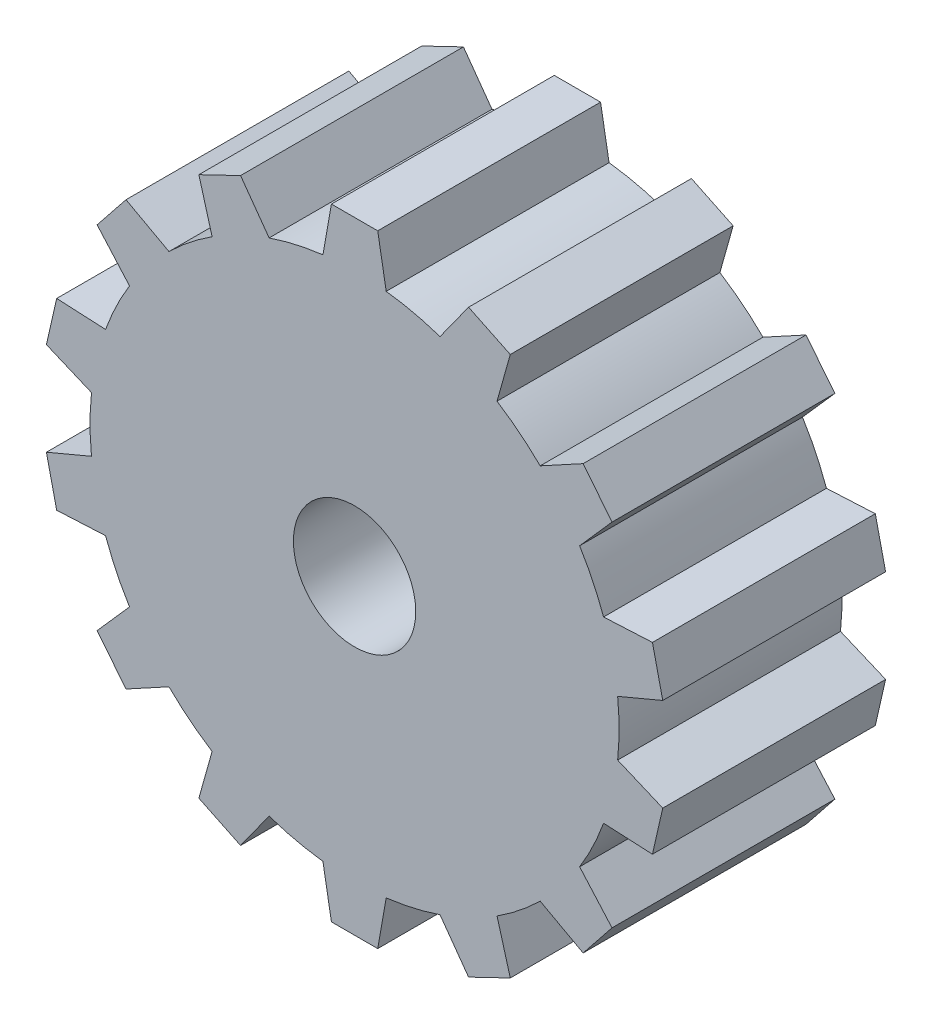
ISO-10303-21;
HEADER;
FILE_DESCRIPTION(('STEP AP214'),'2;1');
FILE_NAME('part.step','',(''),(''),'','','');
FILE_SCHEMA(('AUTOMOTIVE_DESIGN { 1 0 10303 214 1 1 1 1 }'));
ENDSEC;
DATA;
#1=APPLICATION_CONTEXT('core data for automotive mechanical design processes');
#2=APPLICATION_PROTOCOL_DEFINITION('international standard','automotive_design',2000,#1);
#3=PRODUCT_CONTEXT('',#1,'mechanical');
#4=PRODUCT('Part','Part','',(#3));
#5=PRODUCT_RELATED_PRODUCT_CATEGORY('part','',(#4));
#6=PRODUCT_DEFINITION_FORMATION('','',#4);
#7=PRODUCT_DEFINITION_CONTEXT('part definition',#1,'design');
#8=PRODUCT_DEFINITION('design','',#6,#7);
#9=PRODUCT_DEFINITION_SHAPE('','',#8);
#10=(LENGTH_UNIT() NAMED_UNIT(*) SI_UNIT(.MILLI.,.METRE.));
#11=(NAMED_UNIT(*) PLANE_ANGLE_UNIT() SI_UNIT($,.RADIAN.));
#12=(NAMED_UNIT(*) SI_UNIT($,.STERADIAN.) SOLID_ANGLE_UNIT());
#13=UNCERTAINTY_MEASURE_WITH_UNIT(LENGTH_MEASURE(1.E-05),#10,'distance_accuracy_value','');
#14=(GEOMETRIC_REPRESENTATION_CONTEXT(3) GLOBAL_UNCERTAINTY_ASSIGNED_CONTEXT((#13)) GLOBAL_UNIT_ASSIGNED_CONTEXT((#10,
#11,#12)) REPRESENTATION_CONTEXT('',''));
#15=CARTESIAN_POINT('',(0.,0.,0.));
#16=DIRECTION('',(0.,0.,1.));
#17=DIRECTION('',(1.,0.,0.));
#18=AXIS2_PLACEMENT_3D('',#15,#16,#17);
#19=CARTESIAN_POINT('',(0.,0.,3.37));
#20=DIRECTION('',(0.,0.,-1.));
#21=DIRECTION('',(-1.,0.,0.));
#22=AXIS2_PLACEMENT_3D('',#19,#20,#21);
#23=CYLINDRICAL_SURFACE('',#22,4.);
#24=CARTESIAN_POINT('',(0.,0.,3.37));
#25=DIRECTION('',(0.,0.,1.));
#26=DIRECTION('',(1.,0.,0.));
#27=AXIS2_PLACEMENT_3D('',#24,#25,#26);
#28=CIRCLE('',#27,4.);
#29=CARTESIAN_POINT('',(-2.15418038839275,3.3703867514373,3.37));
#30=VERTEX_POINT('',#29);
#31=CARTESIAN_POINT('',(-2.80653388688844,2.85015219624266,3.37));
#32=VERTEX_POINT('',#31);
#33=EDGE_CURVE('E55',#30,#32,#28,.T.);
#34=ORIENTED_EDGE('',*,*,#33,.F.);
#35=DIRECTION('',(0.,0.,-1.));
#36=VECTOR('',#35,1.);
#37=CARTESIAN_POINT('',(-2.15418038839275,3.3703867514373,3.37));
#38=LINE('',#37,#36);
#39=CARTESIAN_POINT('',(-2.15418038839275,3.3703867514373,0.));
#40=VERTEX_POINT('',#39);
#41=EDGE_CURVE('E434',#30,#40,#38,.T.);
#42=ORIENTED_EDGE('',*,*,#41,.T.);
#43=CARTESIAN_POINT('',(0.,0.,0.));
#44=DIRECTION('',(0.,0.,1.));
#45=DIRECTION('',(1.,0.,0.));
#46=AXIS2_PLACEMENT_3D('',#43,#44,#45);
#47=CIRCLE('',#46,4.);
#48=CARTESIAN_POINT('',(-2.80653388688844,2.85015219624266,0.));
#49=VERTEX_POINT('',#48);
#50=EDGE_CURVE('E921',#40,#49,#47,.T.);
#51=ORIENTED_EDGE('',*,*,#50,.T.);
#52=DIRECTION('',(0.,0.,-1.));
#53=VECTOR('',#52,1.);
#54=CARTESIAN_POINT('',(-2.80653388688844,2.85015219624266,3.37));
#55=LINE('',#54,#53);
#56=EDGE_CURVE('E450',#49,#32,#55,.F.);
#57=ORIENTED_EDGE('',*,*,#56,.T.);
#58=EDGE_LOOP('',(#34,#42,#51,#57));
#59=FACE_BOUND('',#58,.T.);
#60=ADVANCED_FACE('F45',(#59),#23,.T.);
#61=CARTESIAN_POINT('',(-3.40320547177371,2.10194969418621,3.37));
#62=VERTEX_POINT('',#61);
#63=CARTESIAN_POINT('',(-3.76523435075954,1.35018898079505,3.37));
#64=VERTEX_POINT('',#63);
#65=EDGE_CURVE('E1044',#62,#64,#28,.T.);
#66=ORIENTED_EDGE('',*,*,#65,.F.);
#67=DIRECTION('',(0.,0.,-1.));
#68=VECTOR('',#67,1.);
#69=CARTESIAN_POINT('',(-3.40320547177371,2.10194969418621,3.37));
#70=LINE('',#69,#68);
#71=CARTESIAN_POINT('',(-3.40320547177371,2.10194969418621,0.));
#72=VERTEX_POINT('',#71);
#73=EDGE_CURVE('E469',#62,#72,#70,.T.);
#74=ORIENTED_EDGE('',*,*,#73,.T.);
#75=CARTESIAN_POINT('',(-3.76523435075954,1.35018898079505,0.));
#76=VERTEX_POINT('',#75);
#77=EDGE_CURVE('E925',#72,#76,#47,.T.);
#78=ORIENTED_EDGE('',*,*,#77,.T.);
#79=DIRECTION('',(0.,0.,-1.));
#80=VECTOR('',#79,1.);
#81=CARTESIAN_POINT('',(-3.76523435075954,1.35018898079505,3.37));
#82=LINE('',#81,#80);
#83=EDGE_CURVE('E485',#76,#64,#82,.F.);
#84=ORIENTED_EDGE('',*,*,#83,.T.);
#85=EDGE_LOOP('',(#66,#74,#78,#84));
#86=FACE_BOUND('',#85,.T.);
#87=ADVANCED_FACE('F1034',(#86),#23,.T.);
#88=CARTESIAN_POINT('',(-3.9781839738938,0.417195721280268,3.37));
#89=VERTEX_POINT('',#88);
#90=CARTESIAN_POINT('',(-3.9781839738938,-0.417195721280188,3.37));
#91=VERTEX_POINT('',#90);
#92=EDGE_CURVE('E1049',#89,#91,#28,.T.);
#93=ORIENTED_EDGE('',*,*,#92,.F.);
#94=DIRECTION('',(0.,0.,-1.));
#95=VECTOR('',#94,1.);
#96=CARTESIAN_POINT('',(-3.9781839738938,0.417195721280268,3.37));
#97=LINE('',#96,#95);
#98=CARTESIAN_POINT('',(-3.9781839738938,0.417195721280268,0.));
#99=VERTEX_POINT('',#98);
#100=EDGE_CURVE('E505',#89,#99,#97,.T.);
#101=ORIENTED_EDGE('',*,*,#100,.T.);
#102=CARTESIAN_POINT('',(-3.9781839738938,-0.417195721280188,0.));
#103=VERTEX_POINT('',#102);
#104=EDGE_CURVE('E928',#99,#103,#47,.T.);
#105=ORIENTED_EDGE('',*,*,#104,.T.);
#106=DIRECTION('',(0.,0.,-1.));
#107=VECTOR('',#106,1.);
#108=CARTESIAN_POINT('',(-3.9781839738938,-0.417195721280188,3.37));
#109=LINE('',#108,#107);
#110=EDGE_CURVE('E521',#103,#91,#109,.F.);
#111=ORIENTED_EDGE('',*,*,#110,.T.);
#112=EDGE_LOOP('',(#93,#101,#105,#111));
#113=FACE_BOUND('',#112,.T.);
#114=ADVANCED_FACE('F1039',(#113),#23,.T.);
#115=CARTESIAN_POINT('',(-3.76523435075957,-1.35018898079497,3.37));
#116=VERTEX_POINT('',#115);
#117=CARTESIAN_POINT('',(-3.40320547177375,-2.10194969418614,3.37));
#118=VERTEX_POINT('',#117);
#119=EDGE_CURVE('E1426',#116,#118,#28,.T.);
#120=ORIENTED_EDGE('',*,*,#119,.F.);
#121=DIRECTION('',(0.,0.,-1.));
#122=VECTOR('',#121,1.);
#123=CARTESIAN_POINT('',(-3.76523435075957,-1.35018898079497,3.37));
#124=LINE('',#123,#122);
#125=CARTESIAN_POINT('',(-3.76523435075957,-1.35018898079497,0.));
#126=VERTEX_POINT('',#125);
#127=EDGE_CURVE('E541',#116,#126,#124,.T.);
#128=ORIENTED_EDGE('',*,*,#127,.T.);
#129=CARTESIAN_POINT('',(-3.40320547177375,-2.10194969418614,0.));
#130=VERTEX_POINT('',#129);
#131=EDGE_CURVE('E932',#126,#130,#47,.T.);
#132=ORIENTED_EDGE('',*,*,#131,.T.);
#133=DIRECTION('',(0.,0.,-1.));
#134=VECTOR('',#133,1.);
#135=CARTESIAN_POINT('',(-3.40320547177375,-2.10194969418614,3.37));
#136=LINE('',#135,#134);
#137=EDGE_CURVE('E557',#130,#118,#136,.F.);
#138=ORIENTED_EDGE('',*,*,#137,.T.);
#139=EDGE_LOOP('',(#120,#128,#132,#138));
#140=FACE_BOUND('',#139,.T.);
#141=ADVANCED_FACE('F1043',(#140),#23,.T.);
#142=CARTESIAN_POINT('',(-2.8065338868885,-2.8501521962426,3.37));
#143=VERTEX_POINT('',#142);
#144=CARTESIAN_POINT('',(-2.15418038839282,-3.37038675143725,3.37));
#145=VERTEX_POINT('',#144);
#146=EDGE_CURVE('E1428',#143,#145,#28,.T.);
#147=ORIENTED_EDGE('',*,*,#146,.F.);
#148=DIRECTION('',(0.,0.,-1.));
#149=VECTOR('',#148,1.);
#150=CARTESIAN_POINT('',(-2.8065338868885,-2.8501521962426,3.37));
#151=LINE('',#150,#149);
#152=CARTESIAN_POINT('',(-2.8065338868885,-2.8501521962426,0.));
#153=VERTEX_POINT('',#152);
#154=EDGE_CURVE('E577',#143,#153,#151,.T.);
#155=ORIENTED_EDGE('',*,*,#154,.T.);
#156=CARTESIAN_POINT('',(-2.15418038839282,-3.37038675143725,0.));
#157=VERTEX_POINT('',#156);
#158=EDGE_CURVE('E936',#153,#157,#47,.T.);
#159=ORIENTED_EDGE('',*,*,#158,.T.);
#160=DIRECTION('',(0.,0.,-1.));
#161=VECTOR('',#160,1.);
#162=CARTESIAN_POINT('',(-2.15418038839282,-3.37038675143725,3.37));
#163=LINE('',#162,#161);
#164=EDGE_CURVE('E593',#157,#145,#163,.F.);
#165=ORIENTED_EDGE('',*,*,#164,.T.);
#166=EDGE_LOOP('',(#147,#155,#159,#165));
#167=FACE_BOUND('',#166,.T.);
#168=ADVANCED_FACE('F1492',(#167),#23,.T.);
#169=CARTESIAN_POINT('',(-1.29196496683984,-3.78560781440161,3.37));
#170=VERTEX_POINT('',#169);
#171=CARTESIAN_POINT('',(-0.47849345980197,-3.97127737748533,3.37));
#172=VERTEX_POINT('',#171);
#173=EDGE_CURVE('E1430',#170,#172,#28,.T.);
#174=ORIENTED_EDGE('',*,*,#173,.F.);
#175=DIRECTION('',(0.,0.,-1.));
#176=VECTOR('',#175,1.);
#177=CARTESIAN_POINT('',(-1.29196496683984,-3.78560781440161,3.37));
#178=LINE('',#177,#176);
#179=CARTESIAN_POINT('',(-1.29196496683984,-3.78560781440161,0.));
#180=VERTEX_POINT('',#179);
#181=EDGE_CURVE('E613',#170,#180,#178,.T.);
#182=ORIENTED_EDGE('',*,*,#181,.T.);
#183=CARTESIAN_POINT('',(-0.47849345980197,-3.97127737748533,0.));
#184=VERTEX_POINT('',#183);
#185=EDGE_CURVE('E940',#180,#184,#47,.T.);
#186=ORIENTED_EDGE('',*,*,#185,.T.);
#187=DIRECTION('',(0.,0.,-1.));
#188=VECTOR('',#187,1.);
#189=CARTESIAN_POINT('',(-0.47849345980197,-3.97127737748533,3.37));
#190=LINE('',#189,#188);
#191=EDGE_CURVE('E629',#184,#172,#190,.F.);
#192=ORIENTED_EDGE('',*,*,#191,.T.);
#193=EDGE_LOOP('',(#174,#182,#186,#192));
#194=FACE_BOUND('',#193,.T.);
#195=ADVANCED_FACE('F1482',(#194),#23,.T.);
#196=CARTESIAN_POINT('',(0.47849345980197,-3.97127737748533,3.37));
#197=VERTEX_POINT('',#196);
#198=CARTESIAN_POINT('',(1.29196496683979,-3.78560781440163,3.37));
#199=VERTEX_POINT('',#198);
#200=EDGE_CURVE('E1432',#197,#199,#28,.T.);
#201=ORIENTED_EDGE('',*,*,#200,.F.);
#202=DIRECTION('',(0.,0.,-1.));
#203=VECTOR('',#202,1.);
#204=CARTESIAN_POINT('',(0.47849345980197,-3.97127737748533,3.37));
#205=LINE('',#204,#203);
#206=CARTESIAN_POINT('',(0.478493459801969,-3.97127737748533,0.));
#207=VERTEX_POINT('',#206);
#208=EDGE_CURVE('E649',#197,#207,#205,.T.);
#209=ORIENTED_EDGE('',*,*,#208,.T.);
#210=CARTESIAN_POINT('',(1.29196496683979,-3.78560781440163,0.));
#211=VERTEX_POINT('',#210);
#212=EDGE_CURVE('E944',#207,#211,#47,.T.);
#213=ORIENTED_EDGE('',*,*,#212,.T.);
#214=DIRECTION('',(0.,0.,-1.));
#215=VECTOR('',#214,1.);
#216=CARTESIAN_POINT('',(1.29196496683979,-3.78560781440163,3.37));
#217=LINE('',#216,#215);
#218=EDGE_CURVE('E665',#211,#199,#217,.F.);
#219=ORIENTED_EDGE('',*,*,#218,.T.);
#220=EDGE_LOOP('',(#201,#209,#213,#219));
#221=FACE_BOUND('',#220,.T.);
#222=ADVANCED_FACE('F1472',(#221),#23,.T.);
#223=CARTESIAN_POINT('',(2.15418038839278,-3.37038675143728,3.37));
#224=VERTEX_POINT('',#223);
#225=CARTESIAN_POINT('',(2.80653388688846,-2.85015219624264,3.37));
#226=VERTEX_POINT('',#225);
#227=EDGE_CURVE('E1434',#224,#226,#28,.T.);
#228=ORIENTED_EDGE('',*,*,#227,.F.);
#229=DIRECTION('',(0.,0.,-1.));
#230=VECTOR('',#229,1.);
#231=CARTESIAN_POINT('',(2.15418038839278,-3.37038675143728,3.37));
#232=LINE('',#231,#230);
#233=CARTESIAN_POINT('',(2.15418038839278,-3.37038675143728,0.));
#234=VERTEX_POINT('',#233);
#235=EDGE_CURVE('E685',#224,#234,#232,.T.);
#236=ORIENTED_EDGE('',*,*,#235,.T.);
#237=CARTESIAN_POINT('',(2.80653388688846,-2.85015219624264,0.));
#238=VERTEX_POINT('',#237);
#239=EDGE_CURVE('E948',#234,#238,#47,.T.);
#240=ORIENTED_EDGE('',*,*,#239,.T.);
#241=DIRECTION('',(0.,0.,-1.));
#242=VECTOR('',#241,1.);
#243=CARTESIAN_POINT('',(2.80653388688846,-2.85015219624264,3.37));
#244=LINE('',#243,#242);
#245=EDGE_CURVE('E701',#238,#226,#244,.F.);
#246=ORIENTED_EDGE('',*,*,#245,.T.);
#247=EDGE_LOOP('',(#228,#236,#240,#246));
#248=FACE_BOUND('',#247,.T.);
#249=ADVANCED_FACE('F1462',(#248),#23,.T.);
#250=CARTESIAN_POINT('',(3.40320547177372,-2.10194969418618,3.37));
#251=VERTEX_POINT('',#250);
#252=CARTESIAN_POINT('',(3.76523435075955,-1.35018898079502,3.37));
#253=VERTEX_POINT('',#252);
#254=EDGE_CURVE('E992',#251,#253,#28,.T.);
#255=ORIENTED_EDGE('',*,*,#254,.F.);
#256=DIRECTION('',(0.,0.,-1.));
#257=VECTOR('',#256,1.);
#258=CARTESIAN_POINT('',(3.40320547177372,-2.10194969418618,3.37));
#259=LINE('',#258,#257);
#260=CARTESIAN_POINT('',(3.40320547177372,-2.10194969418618,0.));
#261=VERTEX_POINT('',#260);
#262=EDGE_CURVE('E721',#251,#261,#259,.T.);
#263=ORIENTED_EDGE('',*,*,#262,.T.);
#264=CARTESIAN_POINT('',(3.76523435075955,-1.35018898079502,0.));
#265=VERTEX_POINT('',#264);
#266=EDGE_CURVE('E952',#261,#265,#47,.T.);
#267=ORIENTED_EDGE('',*,*,#266,.T.);
#268=DIRECTION('',(0.,0.,-1.));
#269=VECTOR('',#268,1.);
#270=CARTESIAN_POINT('',(3.76523435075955,-1.35018898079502,3.37));
#271=LINE('',#270,#269);
#272=EDGE_CURVE('E737',#265,#253,#271,.F.);
#273=ORIENTED_EDGE('',*,*,#272,.T.);
#274=EDGE_LOOP('',(#255,#263,#267,#273));
#275=FACE_BOUND('',#274,.T.);
#276=ADVANCED_FACE('F1439',(#275),#23,.T.);
#277=CARTESIAN_POINT('',(3.9781839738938,-0.417195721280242,3.37));
#278=VERTEX_POINT('',#277);
#279=CARTESIAN_POINT('',(3.9781839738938,0.417195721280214,3.37));
#280=VERTEX_POINT('',#279);
#281=EDGE_CURVE('E989',#278,#280,#28,.T.);
#282=ORIENTED_EDGE('',*,*,#281,.F.);
#283=DIRECTION('',(0.,0.,-1.));
#284=VECTOR('',#283,1.);
#285=CARTESIAN_POINT('',(3.9781839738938,-0.417195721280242,3.37));
#286=LINE('',#285,#284);
#287=CARTESIAN_POINT('',(3.9781839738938,-0.417195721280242,0.));
#288=VERTEX_POINT('',#287);
#289=EDGE_CURVE('E757',#278,#288,#286,.T.);
#290=ORIENTED_EDGE('',*,*,#289,.T.);
#291=CARTESIAN_POINT('',(3.9781839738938,0.417195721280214,0.));
#292=VERTEX_POINT('',#291);
#293=EDGE_CURVE('E956',#288,#292,#47,.T.);
#294=ORIENTED_EDGE('',*,*,#293,.T.);
#295=DIRECTION('',(0.,0.,-1.));
#296=VECTOR('',#295,1.);
#297=CARTESIAN_POINT('',(3.9781839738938,0.417195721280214,3.37));
#298=LINE('',#297,#296);
#299=EDGE_CURVE('E773',#292,#280,#298,.F.);
#300=ORIENTED_EDGE('',*,*,#299,.T.);
#301=EDGE_LOOP('',(#282,#290,#294,#300));
#302=FACE_BOUND('',#301,.T.);
#303=ADVANCED_FACE('F1448',(#302),#23,.T.);
#304=CARTESIAN_POINT('',(3.76523435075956,1.350188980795,3.37));
#305=VERTEX_POINT('',#304);
#306=CARTESIAN_POINT('',(3.40320547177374,2.10194969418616,3.37));
#307=VERTEX_POINT('',#306);
#308=EDGE_CURVE('E986',#305,#307,#28,.T.);
#309=ORIENTED_EDGE('',*,*,#308,.F.);
#310=DIRECTION('',(0.,0.,-1.));
#311=VECTOR('',#310,1.);
#312=CARTESIAN_POINT('',(3.76523435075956,1.350188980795,3.37));
#313=LINE('',#312,#311);
#314=CARTESIAN_POINT('',(3.76523435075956,1.350188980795,0.));
#315=VERTEX_POINT('',#314);
#316=EDGE_CURVE('E793',#305,#315,#313,.T.);
#317=ORIENTED_EDGE('',*,*,#316,.T.);
#318=CARTESIAN_POINT('',(3.40320547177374,2.10194969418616,0.));
#319=VERTEX_POINT('',#318);
#320=EDGE_CURVE('E919',#315,#319,#47,.T.);
#321=ORIENTED_EDGE('',*,*,#320,.T.);
#322=DIRECTION('',(0.,0.,-1.));
#323=VECTOR('',#322,1.);
#324=CARTESIAN_POINT('',(3.40320547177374,2.10194969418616,3.37));
#325=LINE('',#324,#323);
#326=EDGE_CURVE('E809',#319,#307,#325,.F.);
#327=ORIENTED_EDGE('',*,*,#326,.T.);
#328=EDGE_LOOP('',(#309,#317,#321,#327));
#329=FACE_BOUND('',#328,.T.);
#330=ADVANCED_FACE('F965',(#329),#23,.T.);
#331=CARTESIAN_POINT('',(2.80653388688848,2.85015219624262,3.37));
#332=VERTEX_POINT('',#331);
#333=CARTESIAN_POINT('',(2.1541803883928,3.37038675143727,3.37));
#334=VERTEX_POINT('',#333);
#335=EDGE_CURVE('E924',#332,#334,#28,.T.);
#336=ORIENTED_EDGE('',*,*,#335,.F.);
#337=DIRECTION('',(0.,0.,-1.));
#338=VECTOR('',#337,1.);
#339=CARTESIAN_POINT('',(2.80653388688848,2.85015219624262,3.37));
#340=LINE('',#339,#338);
#341=CARTESIAN_POINT('',(2.80653388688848,2.85015219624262,0.));
#342=VERTEX_POINT('',#341);
#343=EDGE_CURVE('E829',#332,#342,#340,.T.);
#344=ORIENTED_EDGE('',*,*,#343,.T.);
#345=CARTESIAN_POINT('',(2.1541803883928,3.37038675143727,0.));
#346=VERTEX_POINT('',#345);
#347=EDGE_CURVE('E915',#342,#346,#47,.T.);
#348=ORIENTED_EDGE('',*,*,#347,.T.);
#349=DIRECTION('',(0.,0.,-1.));
#350=VECTOR('',#349,1.);
#351=CARTESIAN_POINT('',(2.1541803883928,3.37038675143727,3.37));
#352=LINE('',#351,#350);
#353=EDGE_CURVE('E845',#346,#334,#352,.F.);
#354=ORIENTED_EDGE('',*,*,#353,.T.);
#355=EDGE_LOOP('',(#336,#344,#348,#354));
#356=FACE_BOUND('',#355,.T.);
#357=ADVANCED_FACE('F996',(#356),#23,.T.);
#358=CARTESIAN_POINT('',(1.29196496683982,3.78560781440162,3.37));
#359=VERTEX_POINT('',#358);
#360=CARTESIAN_POINT('',(0.47849345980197,3.97127737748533,3.37));
#361=VERTEX_POINT('',#360);
#362=EDGE_CURVE('E56',#359,#361,#28,.T.);
#363=ORIENTED_EDGE('',*,*,#362,.F.);
#364=DIRECTION('',(0.,0.,-1.));
#365=VECTOR('',#364,1.);
#366=CARTESIAN_POINT('',(1.29196496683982,3.78560781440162,3.37));
#367=LINE('',#366,#365);
#368=CARTESIAN_POINT('',(1.29196496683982,3.78560781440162,0.));
#369=VERTEX_POINT('',#368);
#370=EDGE_CURVE('E865',#359,#369,#367,.T.);
#371=ORIENTED_EDGE('',*,*,#370,.T.);
#372=CARTESIAN_POINT('',(0.47849345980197,3.97127737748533,0.));
#373=VERTEX_POINT('',#372);
#374=EDGE_CURVE('E911',#369,#373,#47,.T.);
#375=ORIENTED_EDGE('',*,*,#374,.T.);
#376=DIRECTION('',(0.,0.,-1.));
#377=VECTOR('',#376,1.);
#378=CARTESIAN_POINT('',(0.47849345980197,3.97127737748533,3.37));
#379=LINE('',#378,#377);
#380=EDGE_CURVE('E881',#373,#361,#379,.F.);
#381=ORIENTED_EDGE('',*,*,#380,.T.);
#382=EDGE_LOOP('',(#363,#371,#375,#381));
#383=FACE_BOUND('',#382,.T.);
#384=ADVANCED_FACE('F1011',(#383),#23,.T.);
#385=CARTESIAN_POINT('',(-0.478493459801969,3.97127737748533,0.));
#386=VERTEX_POINT('',#385);
#387=CARTESIAN_POINT('',(-1.29196496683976,3.78560781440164,0.));
#388=VERTEX_POINT('',#387);
#389=EDGE_CURVE('E49',#386,#388,#47,.T.);
#390=ORIENTED_EDGE('',*,*,#389,.T.);
#391=DIRECTION('',(0.,0.,-1.));
#392=VECTOR('',#391,1.);
#393=CARTESIAN_POINT('',(-1.29196496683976,3.78560781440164,3.37));
#394=LINE('',#393,#392);
#395=CARTESIAN_POINT('',(-1.29196496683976,3.78560781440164,3.37));
#396=VERTEX_POINT('',#395);
#397=EDGE_CURVE('E70',#388,#396,#394,.F.);
#398=ORIENTED_EDGE('',*,*,#397,.T.);
#399=CARTESIAN_POINT('',(-0.47849345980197,3.97127737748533,3.37));
#400=VERTEX_POINT('',#399);
#401=EDGE_CURVE('E11',#400,#396,#28,.T.);
#402=ORIENTED_EDGE('',*,*,#401,.F.);
#403=DIRECTION('',(0.,0.,-1.));
#404=VECTOR('',#403,1.);
#405=CARTESIAN_POINT('',(-0.47849345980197,3.97127737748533,3.37));
#406=LINE('',#405,#404);
#407=EDGE_CURVE('E900',#400,#386,#406,.T.);
#408=ORIENTED_EDGE('',*,*,#407,.T.);
#409=EDGE_LOOP('',(#390,#398,#402,#408));
#410=FACE_BOUND('',#409,.T.);
#411=ADVANCED_FACE('F47',(#410),#23,.T.);
#412=CARTESIAN_POINT('',(0.,0.,3.37));
#413=DIRECTION('',(0.,0.,1.));
#414=DIRECTION('',(1.,0.,0.));
#415=AXIS2_PLACEMENT_3D('',#412,#413,#414);
#416=PLANE('',#415);
#417=ORIENTED_EDGE('',*,*,#401,.T.);
#418=DIRECTION('',(-0.583743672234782,0.811938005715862,0.));
#419=VECTOR('',#418,1.);
#420=CARTESIAN_POINT('',(-1.72391447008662,4.38641298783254,3.37));
#421=LINE('',#420,#419);
#422=CARTESIAN_POINT('',(-1.72391447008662,4.38641298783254,3.37));
#423=VERTEX_POINT('',#422);
#424=EDGE_CURVE('E400',#396,#423,#421,.T.);
#425=ORIENTED_EDGE('',*,*,#424,.T.);
#426=DIRECTION('',(-0.900968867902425,-0.433883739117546,0.));
#427=VECTOR('',#426,1.);
#428=CARTESIAN_POINT('',(-2.35459267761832,4.08269437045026,3.37));
#429=LINE('',#428,#427);
#430=CARTESIAN_POINT('',(-2.35459267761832,4.08269437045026,3.37));
#431=VERTEX_POINT('',#430);
#432=EDGE_CURVE('E406',#423,#431,#429,.T.);
#433=ORIENTED_EDGE('',*,*,#432,.T.);
#434=DIRECTION('',(0.270840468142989,-0.962624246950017,0.));
#435=VECTOR('',#434,1.);
#436=CARTESIAN_POINT('',(-1.99706847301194,2.81197780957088,3.37));
#437=LINE('',#436,#435);
#438=EDGE_CURVE('E410',#431,#30,#437,.T.);
#439=ORIENTED_EDGE('',*,*,#438,.T.);
#440=ORIENTED_EDGE('',*,*,#33,.T.);
#441=DIRECTION('',(-0.878221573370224,0.478253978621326,0.));
#442=VECTOR('',#441,1.);
#443=CARTESIAN_POINT('',(-3.45638653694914,3.2040430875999,3.37));
#444=LINE('',#443,#442);
#445=CARTESIAN_POINT('',(-3.45638653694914,3.2040430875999,3.37));
#446=VERTEX_POINT('',#445);
#447=EDGE_CURVE('E454',#32,#446,#444,.T.);
#448=ORIENTED_EDGE('',*,*,#447,.T.);
#449=DIRECTION('',(-0.623489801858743,-0.781831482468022,0.));
#450=VECTOR('',#449,1.);
#451=CARTESIAN_POINT('',(-3.89282939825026,2.65676104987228,3.37));
#452=LINE('',#451,#450);
#453=CARTESIAN_POINT('',(-3.89282939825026,2.65676104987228,3.37));
#454=VERTEX_POINT('',#453);
#455=EDGE_CURVE('E457',#446,#454,#452,.T.);
#456=ORIENTED_EDGE('',*,*,#455,.T.);
#457=DIRECTION('',(0.661685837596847,-0.749781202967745,0.));
#458=VECTOR('',#457,1.);
#459=CARTESIAN_POINT('',(-3.01936796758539,1.66700892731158,3.37));
#460=LINE('',#459,#458);
#461=EDGE_CURVE('E438',#454,#62,#460,.T.);
#462=ORIENTED_EDGE('',*,*,#461,.T.);
#463=ORIENTED_EDGE('',*,*,#65,.T.);
#464=DIRECTION('',(-0.998756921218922,0.0498458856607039,0.));
#465=VECTOR('',#464,1.);
#466=CARTESIAN_POINT('',(-4.50427886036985,1.38707315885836,3.37));
#467=LINE('',#466,#465);
#468=CARTESIAN_POINT('',(-4.50427886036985,1.38707315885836,3.37));
#469=VERTEX_POINT('',#468);
#470=EDGE_CURVE('E489',#64,#469,#467,.T.);
#471=ORIENTED_EDGE('',*,*,#470,.T.);
#472=DIRECTION('',(-0.222520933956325,-0.974927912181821,0.));
#473=VECTOR('',#472,1.);
#474=CARTESIAN_POINT('',(-4.66004351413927,0.704623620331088,3.37));
#475=LINE('',#474,#473);
#476=CARTESIAN_POINT('',(-4.66004351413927,0.704623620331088,3.37));
#477=VERTEX_POINT('',#476);
#478=EDGE_CURVE('E492',#469,#477,#475,.T.);
#479=ORIENTED_EDGE('',*,*,#478,.T.);
#480=DIRECTION('',(0.921476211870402,-0.388434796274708,0.));
#481=VECTOR('',#480,1.);
#482=CARTESIAN_POINT('',(-3.44364460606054,0.191868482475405,3.37));
#483=LINE('',#482,#481);
#484=EDGE_CURVE('E473',#477,#89,#483,.T.);
#485=ORIENTED_EDGE('',*,*,#484,.T.);
#486=ORIENTED_EDGE('',*,*,#92,.T.);
#487=DIRECTION('',(-0.92147621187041,-0.388434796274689,0.));
#488=VECTOR('',#487,1.);
#489=CARTESIAN_POINT('',(-4.66004351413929,-0.704623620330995,3.37));
#490=LINE('',#489,#488);
#491=CARTESIAN_POINT('',(-4.66004351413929,-0.704623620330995,3.37));
#492=VERTEX_POINT('',#491);
#493=EDGE_CURVE('E525',#91,#492,#490,.T.);
#494=ORIENTED_EDGE('',*,*,#493,.T.);
#495=DIRECTION('',(0.222520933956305,-0.974927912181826,0.));
#496=VECTOR('',#495,1.);
#497=CARTESIAN_POINT('',(-4.50427886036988,-1.38707315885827,3.37));
#498=LINE('',#497,#496);
#499=CARTESIAN_POINT('',(-4.50427886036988,-1.38707315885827,3.37));
#500=VERTEX_POINT('',#499);
#501=EDGE_CURVE('E528',#492,#500,#498,.T.);
#502=ORIENTED_EDGE('',*,*,#501,.T.);
#503=DIRECTION('',(0.998756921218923,0.0498458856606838,0.));
#504=VECTOR('',#503,1.);
#505=CARTESIAN_POINT('',(-3.18586519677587,-1.32127386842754,3.37));
#506=LINE('',#505,#504);
#507=EDGE_CURVE('E509',#500,#116,#506,.T.);
#508=ORIENTED_EDGE('',*,*,#507,.T.);
#509=ORIENTED_EDGE('',*,*,#119,.T.);
#510=DIRECTION('',(-0.661685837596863,-0.749781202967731,0.));
#511=VECTOR('',#510,1.);
#512=CARTESIAN_POINT('',(-3.89282939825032,-2.6567610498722,3.37));
#513=LINE('',#512,#511);
#514=CARTESIAN_POINT('',(-3.89282939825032,-2.6567610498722,3.37));
#515=VERTEX_POINT('',#514);
#516=EDGE_CURVE('E561',#118,#515,#513,.T.);
#517=ORIENTED_EDGE('',*,*,#516,.T.);
#518=DIRECTION('',(0.623489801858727,-0.781831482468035,0.));
#519=VECTOR('',#518,1.);
#520=CARTESIAN_POINT('',(-3.45638653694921,-3.20404308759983,3.37));
#521=LINE('',#520,#519);
#522=CARTESIAN_POINT('',(-3.45638653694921,-3.20404308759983,3.37));
#523=VERTEX_POINT('',#522);
#524=EDGE_CURVE('E564',#515,#523,#521,.T.);
#525=ORIENTED_EDGE('',*,*,#524,.T.);
#526=DIRECTION('',(0.878221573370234,0.478253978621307,0.));
#527=VECTOR('',#526,1.);
#528=CARTESIAN_POINT('',(-2.29708611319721,-2.57272172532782,3.37));
#529=LINE('',#528,#527);
#530=EDGE_CURVE('E545',#523,#143,#529,.T.);
#531=ORIENTED_EDGE('',*,*,#530,.T.);
#532=ORIENTED_EDGE('',*,*,#146,.T.);
#533=DIRECTION('',(-0.270840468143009,-0.962624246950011,0.));
#534=VECTOR('',#533,1.);
#535=CARTESIAN_POINT('',(-2.3545926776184,-4.08269437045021,3.37));
#536=LINE('',#535,#534);
#537=CARTESIAN_POINT('',(-2.3545926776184,-4.08269437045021,3.37));
#538=VERTEX_POINT('',#537);
#539=EDGE_CURVE('E597',#145,#538,#536,.T.);
#540=ORIENTED_EDGE('',*,*,#539,.T.);
#541=DIRECTION('',(0.900968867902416,-0.433883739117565,0.));
#542=VECTOR('',#541,1.);
#543=CARTESIAN_POINT('',(-1.72391447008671,-4.3864129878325,3.37));
#544=LINE('',#543,#542);
#545=CARTESIAN_POINT('',(-1.72391447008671,-4.3864129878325,3.37));
#546=VERTEX_POINT('',#545);
#547=EDGE_CURVE('E600',#538,#546,#544,.T.);
#548=ORIENTED_EDGE('',*,*,#547,.T.);
#549=DIRECTION('',(0.583743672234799,0.81193800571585,0.));
#550=VECTOR('',#549,1.);
#551=CARTESIAN_POINT('',(-0.953340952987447,-3.31461049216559,3.37));
#552=LINE('',#551,#550);
#553=EDGE_CURVE('E581',#546,#170,#552,.T.);
#554=ORIENTED_EDGE('',*,*,#553,.T.);
#555=ORIENTED_EDGE('',*,*,#173,.T.);
#556=DIRECTION('',(0.173648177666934,-0.984807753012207,0.));
#557=VECTOR('',#556,1.);
#558=CARTESIAN_POINT('',(-0.35,-4.7,3.37));
#559=LINE('',#558,#557);
#560=CARTESIAN_POINT('',(-0.35,-4.7,3.37));
#561=VERTEX_POINT('',#560);
#562=EDGE_CURVE('E633',#172,#561,#559,.T.);
#563=ORIENTED_EDGE('',*,*,#562,.T.);
#564=DIRECTION('',(1.,0.,0.));
#565=VECTOR('',#564,1.);
#566=CARTESIAN_POINT('',(0.35,-4.7,3.37));
#567=LINE('',#566,#565);
#568=CARTESIAN_POINT('',(0.35,-4.7,3.37));
#569=VERTEX_POINT('',#568);
#570=EDGE_CURVE('E636',#561,#569,#567,.T.);
#571=ORIENTED_EDGE('',*,*,#570,.T.);
#572=DIRECTION('',(0.173648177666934,0.984807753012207,0.));
#573=VECTOR('',#572,1.);
#574=CARTESIAN_POINT('',(0.579225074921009,-3.4,3.37));
#575=LINE('',#574,#573);
#576=EDGE_CURVE('E617',#569,#197,#575,.T.);
#577=ORIENTED_EDGE('',*,*,#576,.T.);
#578=ORIENTED_EDGE('',*,*,#200,.T.);
#579=DIRECTION('',(0.583743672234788,-0.811938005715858,0.));
#580=VECTOR('',#579,1.);
#581=CARTESIAN_POINT('',(1.72391447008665,-4.38641298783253,3.37));
#582=LINE('',#581,#580);
#583=CARTESIAN_POINT('',(1.72391447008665,-4.38641298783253,3.37));
#584=VERTEX_POINT('',#583);
#585=EDGE_CURVE('E669',#199,#584,#582,.T.);
#586=ORIENTED_EDGE('',*,*,#585,.T.);
#587=DIRECTION('',(0.900968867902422,0.433883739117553,0.));
#588=VECTOR('',#587,1.);
#589=CARTESIAN_POINT('',(2.35459267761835,-4.08269437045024,3.37));
#590=LINE('',#589,#588);
#591=CARTESIAN_POINT('',(2.35459267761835,-4.08269437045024,3.37));
#592=VERTEX_POINT('',#591);
#593=EDGE_CURVE('E672',#584,#592,#590,.T.);
#594=ORIENTED_EDGE('',*,*,#593,.T.);
#595=DIRECTION('',(-0.270840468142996,0.962624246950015,0.));
#596=VECTOR('',#595,1.);
#597=CARTESIAN_POINT('',(1.99706847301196,-2.81197780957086,3.37));
#598=LINE('',#597,#596);
#599=EDGE_CURVE('E653',#592,#224,#598,.T.);
#600=ORIENTED_EDGE('',*,*,#599,.T.);
#601=ORIENTED_EDGE('',*,*,#227,.T.);
#602=DIRECTION('',(0.878221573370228,-0.478253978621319,0.));
#603=VECTOR('',#602,1.);
#604=CARTESIAN_POINT('',(3.45638653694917,-3.20404308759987,3.37));
#605=LINE('',#604,#603);
#606=CARTESIAN_POINT('',(3.45638653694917,-3.20404308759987,3.37));
#607=VERTEX_POINT('',#606);
#608=EDGE_CURVE('E705',#226,#607,#605,.T.);
#609=ORIENTED_EDGE('',*,*,#608,.T.);
#610=DIRECTION('',(0.623489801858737,0.781831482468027,0.));
#611=VECTOR('',#610,1.);
#612=CARTESIAN_POINT('',(3.89282939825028,-2.65676104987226,3.37));
#613=LINE('',#612,#611);
#614=CARTESIAN_POINT('',(3.89282939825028,-2.65676104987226,3.37));
#615=VERTEX_POINT('',#614);
#616=EDGE_CURVE('E708',#607,#615,#613,.T.);
#617=ORIENTED_EDGE('',*,*,#616,.T.);
#618=DIRECTION('',(-0.661685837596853,0.74978120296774,0.));
#619=VECTOR('',#618,1.);
#620=CARTESIAN_POINT('',(3.0193679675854,-1.66700892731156,3.37));
#621=LINE('',#620,#619);
#622=EDGE_CURVE('E689',#615,#251,#621,.T.);
#623=ORIENTED_EDGE('',*,*,#622,.T.);
#624=ORIENTED_EDGE('',*,*,#254,.T.);
#625=DIRECTION('',(0.998756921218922,-0.0498458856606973,0.));
#626=VECTOR('',#625,1.);
#627=CARTESIAN_POINT('',(4.50427886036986,-1.38707315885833,3.37));
#628=LINE('',#627,#626);
#629=CARTESIAN_POINT('',(4.50427886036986,-1.38707315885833,3.37));
#630=VERTEX_POINT('',#629);
#631=EDGE_CURVE('E741',#253,#630,#628,.T.);
#632=ORIENTED_EDGE('',*,*,#631,.T.);
#633=DIRECTION('',(0.222520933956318,0.974927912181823,0.));
#634=VECTOR('',#633,1.);
#635=CARTESIAN_POINT('',(4.66004351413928,-0.704623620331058,3.37));
#636=LINE('',#635,#634);
#637=CARTESIAN_POINT('',(4.66004351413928,-0.704623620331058,3.37));
#638=VERTEX_POINT('',#637);
#639=EDGE_CURVE('E744',#630,#638,#636,.T.);
#640=ORIENTED_EDGE('',*,*,#639,.T.);
#641=DIRECTION('',(-0.921476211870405,0.388434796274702,0.));
#642=VECTOR('',#641,1.);
#643=CARTESIAN_POINT('',(3.44364460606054,-0.191868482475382,3.37));
#644=LINE('',#643,#642);
#645=EDGE_CURVE('E725',#638,#278,#644,.T.);
#646=ORIENTED_EDGE('',*,*,#645,.T.);
#647=ORIENTED_EDGE('',*,*,#281,.T.);
#648=DIRECTION('',(0.921476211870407,0.388434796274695,0.));
#649=VECTOR('',#648,1.);
#650=CARTESIAN_POINT('',(4.66004351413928,0.704623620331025,3.37));
#651=LINE('',#650,#649);
#652=CARTESIAN_POINT('',(4.66004351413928,0.704623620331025,3.37));
#653=VERTEX_POINT('',#652);
#654=EDGE_CURVE('E777',#280,#653,#651,.T.);
#655=ORIENTED_EDGE('',*,*,#654,.T.);
#656=DIRECTION('',(-0.222520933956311,0.974927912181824,0.));
#657=VECTOR('',#656,1.);
#658=CARTESIAN_POINT('',(4.50427886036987,1.3870731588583,3.37));
#659=LINE('',#658,#657);
#660=CARTESIAN_POINT('',(4.50427886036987,1.3870731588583,3.37));
#661=VERTEX_POINT('',#660);
#662=EDGE_CURVE('E780',#653,#661,#659,.T.);
#663=ORIENTED_EDGE('',*,*,#662,.T.);
#664=DIRECTION('',(-0.998756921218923,-0.0498458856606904,0.));
#665=VECTOR('',#664,1.);
#666=CARTESIAN_POINT('',(3.18586519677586,1.32127386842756,3.37));
#667=LINE('',#666,#665);
#668=EDGE_CURVE('E761',#661,#305,#667,.T.);
#669=ORIENTED_EDGE('',*,*,#668,.T.);
#670=ORIENTED_EDGE('',*,*,#308,.T.);
#671=DIRECTION('',(0.661685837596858,0.749781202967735,0.));
#672=VECTOR('',#671,1.);
#673=CARTESIAN_POINT('',(3.8928293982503,2.65676104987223,3.37));
#674=LINE('',#673,#672);
#675=CARTESIAN_POINT('',(3.8928293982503,2.65676104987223,3.37));
#676=VERTEX_POINT('',#675);
#677=EDGE_CURVE('E813',#307,#676,#674,.T.);
#678=ORIENTED_EDGE('',*,*,#677,.T.);
#679=DIRECTION('',(-0.623489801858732,0.781831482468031,0.));
#680=VECTOR('',#679,1.);
#681=CARTESIAN_POINT('',(3.45638653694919,3.20404308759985,3.37));
#682=LINE('',#681,#680);
#683=CARTESIAN_POINT('',(3.45638653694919,3.20404308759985,3.37));
#684=VERTEX_POINT('',#683);
#685=EDGE_CURVE('E816',#676,#684,#682,.T.);
#686=ORIENTED_EDGE('',*,*,#685,.T.);
#687=DIRECTION('',(-0.878221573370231,-0.478253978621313,0.));
#688=VECTOR('',#687,1.);
#689=CARTESIAN_POINT('',(2.2970861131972,2.57272172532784,3.37));
#690=LINE('',#689,#688);
#691=EDGE_CURVE('E797',#684,#332,#690,.T.);
#692=ORIENTED_EDGE('',*,*,#691,.T.);
#693=ORIENTED_EDGE('',*,*,#335,.T.);
#694=DIRECTION('',(0.270840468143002,0.962624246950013,0.));
#695=VECTOR('',#694,1.);
#696=CARTESIAN_POINT('',(2.35459267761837,4.08269437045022,3.37));
#697=LINE('',#696,#695);
#698=CARTESIAN_POINT('',(2.35459267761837,4.08269437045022,3.37));
#699=VERTEX_POINT('',#698);
#700=EDGE_CURVE('E849',#334,#699,#697,.T.);
#701=ORIENTED_EDGE('',*,*,#700,.T.);
#702=DIRECTION('',(-0.900968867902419,0.433883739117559,0.));
#703=VECTOR('',#702,1.);
#704=CARTESIAN_POINT('',(1.72391447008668,4.38641298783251,3.37));
#705=LINE('',#704,#703);
#706=CARTESIAN_POINT('',(1.72391447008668,4.38641298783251,3.37));
#707=VERTEX_POINT('',#706);
#708=EDGE_CURVE('E852',#699,#707,#705,.T.);
#709=ORIENTED_EDGE('',*,*,#708,.T.);
#710=DIRECTION('',(-0.583743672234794,-0.811938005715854,0.));
#711=VECTOR('',#710,1.);
#712=CARTESIAN_POINT('',(0.953340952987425,3.3146104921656,3.37));
#713=LINE('',#712,#711);
#714=EDGE_CURVE('E833',#707,#359,#713,.T.);
#715=ORIENTED_EDGE('',*,*,#714,.T.);
#716=ORIENTED_EDGE('',*,*,#362,.T.);
#717=DIRECTION('',(-0.173648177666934,0.984807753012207,0.));
#718=VECTOR('',#717,1.);
#719=CARTESIAN_POINT('',(0.35,4.7,3.37));
#720=LINE('',#719,#718);
#721=CARTESIAN_POINT('',(0.35,4.7,3.37));
#722=VERTEX_POINT('',#721);
#723=EDGE_CURVE('E884',#361,#722,#720,.T.);
#724=ORIENTED_EDGE('',*,*,#723,.T.);
#725=DIRECTION('',(-1.,0.,0.));
#726=VECTOR('',#725,1.);
#727=CARTESIAN_POINT('',(-0.35,4.7,3.37));
#728=LINE('',#727,#726);
#729=CARTESIAN_POINT('',(-0.35,4.7,3.37));
#730=VERTEX_POINT('',#729);
#731=EDGE_CURVE('E887',#722,#730,#728,.T.);
#732=ORIENTED_EDGE('',*,*,#731,.T.);
#733=DIRECTION('',(-0.173648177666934,-0.984807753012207,0.));
#734=VECTOR('',#733,1.);
#735=CARTESIAN_POINT('',(-0.579225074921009,3.4,3.37));
#736=LINE('',#735,#734);
#737=EDGE_CURVE('E869',#730,#400,#736,.T.);
#738=ORIENTED_EDGE('',*,*,#737,.T.);
#739=EDGE_LOOP('',(#417,#425,#433,#439,#440,#448,#456,#462,#463,#471,#479,#485,#486,#494,#502,
#508,#509,#517,#525,#531,#532,#540,#548,#554,#555,#563,#571,#577,#578,#586,#594,#600,#601,#609,
#617,#623,#624,#632,#640,#646,#647,#655,#663,#669,#670,#678,#686,#692,#693,#701,#709,#715,#716,
#724,#732,#738));
#740=FACE_BOUND('',#739,.T.);
#741=CARTESIAN_POINT('',(0.,0.,3.37));
#742=DIRECTION('',(0.,0.,1.));
#743=DIRECTION('',(1.,0.,0.));
#744=AXIS2_PLACEMENT_3D('',#741,#742,#743);
#745=CIRCLE('',#744,0.925);
#746=CARTESIAN_POINT('',(0.925,0.,3.37));
#747=VERTEX_POINT('',#746);
#748=EDGE_CURVE('E904',#747,#747,#745,.T.);
#749=ORIENTED_EDGE('',*,*,#748,.F.);
#750=EDGE_LOOP('',(#749));
#751=FACE_BOUND('',#750,.T.);
#752=ADVANCED_FACE('F402',(#740,#751),#416,.T.);
#753=CARTESIAN_POINT('',(0.,0.,0.));
#754=DIRECTION('',(0.,0.,1.));
#755=DIRECTION('',(1.,0.,0.));
#756=AXIS2_PLACEMENT_3D('',#753,#754,#755);
#757=PLANE('',#756);
#758=ORIENTED_EDGE('',*,*,#50,.F.);
#759=DIRECTION('',(-0.270840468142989,0.962624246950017,0.));
#760=VECTOR('',#759,1.);
#761=CARTESIAN_POINT('',(-1.99706847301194,2.81197780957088,0.));
#762=LINE('',#761,#760);
#763=CARTESIAN_POINT('',(-2.35459267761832,4.08269437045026,0.));
#764=VERTEX_POINT('',#763);
#765=EDGE_CURVE('E435',#40,#764,#762,.T.);
#766=ORIENTED_EDGE('',*,*,#765,.T.);
#767=DIRECTION('',(0.900968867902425,0.433883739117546,0.));
#768=VECTOR('',#767,1.);
#769=CARTESIAN_POINT('',(-2.35459267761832,4.08269437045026,0.));
#770=LINE('',#769,#768);
#771=CARTESIAN_POINT('',(-1.72391447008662,4.38641298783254,0.));
#772=VERTEX_POINT('',#771);
#773=EDGE_CURVE('E1419',#764,#772,#770,.T.);
#774=ORIENTED_EDGE('',*,*,#773,.T.);
#775=DIRECTION('',(0.583743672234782,-0.811938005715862,0.));
#776=VECTOR('',#775,1.);
#777=CARTESIAN_POINT('',(-1.72391447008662,4.38641298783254,0.));
#778=LINE('',#777,#776);
#779=EDGE_CURVE('E417',#772,#388,#778,.T.);
#780=ORIENTED_EDGE('',*,*,#779,.T.);
#781=ORIENTED_EDGE('',*,*,#389,.F.);
#782=DIRECTION('',(0.173648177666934,0.984807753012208,0.));
#783=VECTOR('',#782,1.);
#784=CARTESIAN_POINT('',(-0.579225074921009,3.4,0.));
#785=LINE('',#784,#783);
#786=CARTESIAN_POINT('',(-0.35,4.7,0.));
#787=VERTEX_POINT('',#786);
#788=EDGE_CURVE('E878',#386,#787,#785,.T.);
#789=ORIENTED_EDGE('',*,*,#788,.T.);
#790=DIRECTION('',(1.,0.,0.));
#791=VECTOR('',#790,1.);
#792=CARTESIAN_POINT('',(-0.35,4.7,0.));
#793=LINE('',#792,#791);
#794=CARTESIAN_POINT('',(0.35,4.7,0.));
#795=VERTEX_POINT('',#794);
#796=EDGE_CURVE('E874',#787,#795,#793,.T.);
#797=ORIENTED_EDGE('',*,*,#796,.T.);
#798=DIRECTION('',(0.173648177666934,-0.984807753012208,0.));
#799=VECTOR('',#798,1.);
#800=CARTESIAN_POINT('',(0.35,4.7,0.));
#801=LINE('',#800,#799);
#802=EDGE_CURVE('E870',#795,#373,#801,.T.);
#803=ORIENTED_EDGE('',*,*,#802,.T.);
#804=ORIENTED_EDGE('',*,*,#374,.F.);
#805=DIRECTION('',(0.583743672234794,0.811938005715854,0.));
#806=VECTOR('',#805,1.);
#807=CARTESIAN_POINT('',(0.953340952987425,3.3146104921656,0.));
#808=LINE('',#807,#806);
#809=CARTESIAN_POINT('',(1.72391447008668,4.38641298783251,0.));
#810=VERTEX_POINT('',#809);
#811=EDGE_CURVE('E842',#369,#810,#808,.T.);
#812=ORIENTED_EDGE('',*,*,#811,.T.);
#813=DIRECTION('',(0.900968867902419,-0.433883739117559,0.));
#814=VECTOR('',#813,1.);
#815=CARTESIAN_POINT('',(1.72391447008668,4.38641298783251,0.));
#816=LINE('',#815,#814);
#817=CARTESIAN_POINT('',(2.35459267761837,4.08269437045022,0.));
#818=VERTEX_POINT('',#817);
#819=EDGE_CURVE('E838',#810,#818,#816,.T.);
#820=ORIENTED_EDGE('',*,*,#819,.T.);
#821=DIRECTION('',(-0.270840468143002,-0.962624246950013,0.));
#822=VECTOR('',#821,1.);
#823=CARTESIAN_POINT('',(2.35459267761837,4.08269437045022,0.));
#824=LINE('',#823,#822);
#825=EDGE_CURVE('E834',#818,#346,#824,.T.);
#826=ORIENTED_EDGE('',*,*,#825,.T.);
#827=ORIENTED_EDGE('',*,*,#347,.F.);
#828=DIRECTION('',(0.878221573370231,0.478253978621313,0.));
#829=VECTOR('',#828,1.);
#830=CARTESIAN_POINT('',(2.2970861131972,2.57272172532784,0.));
#831=LINE('',#830,#829);
#832=CARTESIAN_POINT('',(3.45638653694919,3.20404308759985,0.));
#833=VERTEX_POINT('',#832);
#834=EDGE_CURVE('E806',#342,#833,#831,.T.);
#835=ORIENTED_EDGE('',*,*,#834,.T.);
#836=DIRECTION('',(0.623489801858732,-0.781831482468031,0.));
#837=VECTOR('',#836,1.);
#838=CARTESIAN_POINT('',(3.45638653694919,3.20404308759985,0.));
#839=LINE('',#838,#837);
#840=CARTESIAN_POINT('',(3.8928293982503,2.65676104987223,0.));
#841=VERTEX_POINT('',#840);
#842=EDGE_CURVE('E802',#833,#841,#839,.T.);
#843=ORIENTED_EDGE('',*,*,#842,.T.);
#844=DIRECTION('',(-0.661685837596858,-0.749781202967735,0.));
#845=VECTOR('',#844,1.);
#846=CARTESIAN_POINT('',(3.8928293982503,2.65676104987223,0.));
#847=LINE('',#846,#845);
#848=EDGE_CURVE('E798',#841,#319,#847,.T.);
#849=ORIENTED_EDGE('',*,*,#848,.T.);
#850=ORIENTED_EDGE('',*,*,#320,.F.);
#851=DIRECTION('',(0.998756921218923,0.0498458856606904,0.));
#852=VECTOR('',#851,1.);
#853=CARTESIAN_POINT('',(3.18586519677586,1.32127386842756,0.));
#854=LINE('',#853,#852);
#855=CARTESIAN_POINT('',(4.50427886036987,1.3870731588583,0.));
#856=VERTEX_POINT('',#855);
#857=EDGE_CURVE('E770',#315,#856,#854,.T.);
#858=ORIENTED_EDGE('',*,*,#857,.T.);
#859=DIRECTION('',(0.222520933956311,-0.974927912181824,0.));
#860=VECTOR('',#859,1.);
#861=CARTESIAN_POINT('',(4.50427886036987,1.3870731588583,0.));
#862=LINE('',#861,#860);
#863=CARTESIAN_POINT('',(4.66004351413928,0.704623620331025,0.));
#864=VERTEX_POINT('',#863);
#865=EDGE_CURVE('E766',#856,#864,#862,.T.);
#866=ORIENTED_EDGE('',*,*,#865,.T.);
#867=DIRECTION('',(-0.921476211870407,-0.388434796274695,0.));
#868=VECTOR('',#867,1.);
#869=CARTESIAN_POINT('',(4.66004351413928,0.704623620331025,0.));
#870=LINE('',#869,#868);
#871=EDGE_CURVE('E762',#864,#292,#870,.T.);
#872=ORIENTED_EDGE('',*,*,#871,.T.);
#873=ORIENTED_EDGE('',*,*,#293,.F.);
#874=DIRECTION('',(0.921476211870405,-0.388434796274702,0.));
#875=VECTOR('',#874,1.);
#876=CARTESIAN_POINT('',(3.44364460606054,-0.191868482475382,0.));
#877=LINE('',#876,#875);
#878=CARTESIAN_POINT('',(4.66004351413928,-0.704623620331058,0.));
#879=VERTEX_POINT('',#878);
#880=EDGE_CURVE('E734',#288,#879,#877,.T.);
#881=ORIENTED_EDGE('',*,*,#880,.T.);
#882=DIRECTION('',(-0.222520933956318,-0.974927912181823,0.));
#883=VECTOR('',#882,1.);
#884=CARTESIAN_POINT('',(4.66004351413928,-0.704623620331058,0.));
#885=LINE('',#884,#883);
#886=CARTESIAN_POINT('',(4.50427886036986,-1.38707315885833,0.));
#887=VERTEX_POINT('',#886);
#888=EDGE_CURVE('E730',#879,#887,#885,.T.);
#889=ORIENTED_EDGE('',*,*,#888,.T.);
#890=DIRECTION('',(-0.998756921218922,0.0498458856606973,0.));
#891=VECTOR('',#890,1.);
#892=CARTESIAN_POINT('',(4.50427886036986,-1.38707315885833,0.));
#893=LINE('',#892,#891);
#894=EDGE_CURVE('E726',#887,#265,#893,.T.);
#895=ORIENTED_EDGE('',*,*,#894,.T.);
#896=ORIENTED_EDGE('',*,*,#266,.F.);
#897=DIRECTION('',(0.661685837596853,-0.74978120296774,0.));
#898=VECTOR('',#897,1.);
#899=CARTESIAN_POINT('',(3.0193679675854,-1.66700892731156,0.));
#900=LINE('',#899,#898);
#901=CARTESIAN_POINT('',(3.89282939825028,-2.65676104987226,0.));
#902=VERTEX_POINT('',#901);
#903=EDGE_CURVE('E698',#261,#902,#900,.T.);
#904=ORIENTED_EDGE('',*,*,#903,.T.);
#905=DIRECTION('',(-0.623489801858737,-0.781831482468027,0.));
#906=VECTOR('',#905,1.);
#907=CARTESIAN_POINT('',(3.89282939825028,-2.65676104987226,0.));
#908=LINE('',#907,#906);
#909=CARTESIAN_POINT('',(3.45638653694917,-3.20404308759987,0.));
#910=VERTEX_POINT('',#909);
#911=EDGE_CURVE('E694',#902,#910,#908,.T.);
#912=ORIENTED_EDGE('',*,*,#911,.T.);
#913=DIRECTION('',(-0.878221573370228,0.478253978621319,0.));
#914=VECTOR('',#913,1.);
#915=CARTESIAN_POINT('',(3.45638653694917,-3.20404308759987,0.));
#916=LINE('',#915,#914);
#917=EDGE_CURVE('E690',#910,#238,#916,.T.);
#918=ORIENTED_EDGE('',*,*,#917,.T.);
#919=ORIENTED_EDGE('',*,*,#239,.F.);
#920=DIRECTION('',(0.270840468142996,-0.962624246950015,0.));
#921=VECTOR('',#920,1.);
#922=CARTESIAN_POINT('',(1.99706847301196,-2.81197780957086,0.));
#923=LINE('',#922,#921);
#924=CARTESIAN_POINT('',(2.35459267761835,-4.08269437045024,0.));
#925=VERTEX_POINT('',#924);
#926=EDGE_CURVE('E662',#234,#925,#923,.T.);
#927=ORIENTED_EDGE('',*,*,#926,.T.);
#928=DIRECTION('',(-0.900968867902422,-0.433883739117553,0.));
#929=VECTOR('',#928,1.);
#930=CARTESIAN_POINT('',(2.35459267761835,-4.08269437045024,0.));
#931=LINE('',#930,#929);
#932=CARTESIAN_POINT('',(1.72391447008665,-4.38641298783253,0.));
#933=VERTEX_POINT('',#932);
#934=EDGE_CURVE('E658',#925,#933,#931,.T.);
#935=ORIENTED_EDGE('',*,*,#934,.T.);
#936=DIRECTION('',(-0.583743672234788,0.811938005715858,0.));
#937=VECTOR('',#936,1.);
#938=CARTESIAN_POINT('',(1.72391447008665,-4.38641298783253,0.));
#939=LINE('',#938,#937);
#940=EDGE_CURVE('E654',#933,#211,#939,.T.);
#941=ORIENTED_EDGE('',*,*,#940,.T.);
#942=ORIENTED_EDGE('',*,*,#212,.F.);
#943=DIRECTION('',(-0.173648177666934,-0.984807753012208,0.));
#944=VECTOR('',#943,1.);
#945=CARTESIAN_POINT('',(0.579225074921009,-3.4,0.));
#946=LINE('',#945,#944);
#947=CARTESIAN_POINT('',(0.35,-4.7,0.));
#948=VERTEX_POINT('',#947);
#949=EDGE_CURVE('E626',#207,#948,#946,.T.);
#950=ORIENTED_EDGE('',*,*,#949,.T.);
#951=DIRECTION('',(-1.,0.,0.));
#952=VECTOR('',#951,1.);
#953=CARTESIAN_POINT('',(0.35,-4.7,0.));
#954=LINE('',#953,#952);
#955=CARTESIAN_POINT('',(-0.35,-4.7,0.));
#956=VERTEX_POINT('',#955);
#957=EDGE_CURVE('E622',#948,#956,#954,.T.);
#958=ORIENTED_EDGE('',*,*,#957,.T.);
#959=DIRECTION('',(-0.173648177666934,0.984807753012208,0.));
#960=VECTOR('',#959,1.);
#961=CARTESIAN_POINT('',(-0.35,-4.7,0.));
#962=LINE('',#961,#960);
#963=EDGE_CURVE('E618',#956,#184,#962,.T.);
#964=ORIENTED_EDGE('',*,*,#963,.T.);
#965=ORIENTED_EDGE('',*,*,#185,.F.);
#966=DIRECTION('',(-0.583743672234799,-0.81193800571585,0.));
#967=VECTOR('',#966,1.);
#968=CARTESIAN_POINT('',(-0.953340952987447,-3.31461049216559,0.));
#969=LINE('',#968,#967);
#970=CARTESIAN_POINT('',(-1.72391447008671,-4.3864129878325,0.));
#971=VERTEX_POINT('',#970);
#972=EDGE_CURVE('E590',#180,#971,#969,.T.);
#973=ORIENTED_EDGE('',*,*,#972,.T.);
#974=DIRECTION('',(-0.900968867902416,0.433883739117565,0.));
#975=VECTOR('',#974,1.);
#976=CARTESIAN_POINT('',(-1.72391447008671,-4.3864129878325,0.));
#977=LINE('',#976,#975);
#978=CARTESIAN_POINT('',(-2.3545926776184,-4.08269437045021,0.));
#979=VERTEX_POINT('',#978);
#980=EDGE_CURVE('E586',#971,#979,#977,.T.);
#981=ORIENTED_EDGE('',*,*,#980,.T.);
#982=DIRECTION('',(0.270840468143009,0.962624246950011,0.));
#983=VECTOR('',#982,1.);
#984=CARTESIAN_POINT('',(-2.3545926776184,-4.08269437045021,0.));
#985=LINE('',#984,#983);
#986=EDGE_CURVE('E582',#979,#157,#985,.T.);
#987=ORIENTED_EDGE('',*,*,#986,.T.);
#988=ORIENTED_EDGE('',*,*,#158,.F.);
#989=DIRECTION('',(-0.878221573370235,-0.478253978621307,0.));
#990=VECTOR('',#989,1.);
#991=CARTESIAN_POINT('',(-2.29708611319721,-2.57272172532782,0.));
#992=LINE('',#991,#990);
#993=CARTESIAN_POINT('',(-3.45638653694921,-3.20404308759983,0.));
#994=VERTEX_POINT('',#993);
#995=EDGE_CURVE('E554',#153,#994,#992,.T.);
#996=ORIENTED_EDGE('',*,*,#995,.T.);
#997=DIRECTION('',(-0.623489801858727,0.781831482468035,0.));
#998=VECTOR('',#997,1.);
#999=CARTESIAN_POINT('',(-3.45638653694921,-3.20404308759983,0.));
#1000=LINE('',#999,#998);
#1001=CARTESIAN_POINT('',(-3.89282939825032,-2.6567610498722,0.));
#1002=VERTEX_POINT('',#1001);
#1003=EDGE_CURVE('E550',#994,#1002,#1000,.T.);
#1004=ORIENTED_EDGE('',*,*,#1003,.T.);
#1005=DIRECTION('',(0.661685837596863,0.749781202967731,0.));
#1006=VECTOR('',#1005,1.);
#1007=CARTESIAN_POINT('',(-3.89282939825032,-2.6567610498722,0.));
#1008=LINE('',#1007,#1006);
#1009=EDGE_CURVE('E546',#1002,#130,#1008,.T.);
#1010=ORIENTED_EDGE('',*,*,#1009,.T.);
#1011=ORIENTED_EDGE('',*,*,#131,.F.);
#1012=DIRECTION('',(-0.998756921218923,-0.0498458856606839,0.));
#1013=VECTOR('',#1012,1.);
#1014=CARTESIAN_POINT('',(-3.18586519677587,-1.32127386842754,0.));
#1015=LINE('',#1014,#1013);
#1016=CARTESIAN_POINT('',(-4.50427886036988,-1.38707315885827,0.));
#1017=VERTEX_POINT('',#1016);
#1018=EDGE_CURVE('E518',#126,#1017,#1015,.T.);
#1019=ORIENTED_EDGE('',*,*,#1018,.T.);
#1020=DIRECTION('',(-0.222520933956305,0.974927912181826,0.));
#1021=VECTOR('',#1020,1.);
#1022=CARTESIAN_POINT('',(-4.50427886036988,-1.38707315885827,0.));
#1023=LINE('',#1022,#1021);
#1024=CARTESIAN_POINT('',(-4.66004351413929,-0.704623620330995,0.));
#1025=VERTEX_POINT('',#1024);
#1026=EDGE_CURVE('E514',#1017,#1025,#1023,.T.);
#1027=ORIENTED_EDGE('',*,*,#1026,.T.);
#1028=DIRECTION('',(0.92147621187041,0.388434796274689,0.));
#1029=VECTOR('',#1028,1.);
#1030=CARTESIAN_POINT('',(-4.66004351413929,-0.704623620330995,0.));
#1031=LINE('',#1030,#1029);
#1032=EDGE_CURVE('E510',#1025,#103,#1031,.T.);
#1033=ORIENTED_EDGE('',*,*,#1032,.T.);
#1034=ORIENTED_EDGE('',*,*,#104,.F.);
#1035=DIRECTION('',(-0.921476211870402,0.388434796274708,0.));
#1036=VECTOR('',#1035,1.);
#1037=CARTESIAN_POINT('',(-3.44364460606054,0.191868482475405,0.));
#1038=LINE('',#1037,#1036);
#1039=CARTESIAN_POINT('',(-4.66004351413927,0.704623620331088,0.));
#1040=VERTEX_POINT('',#1039);
#1041=EDGE_CURVE('E482',#99,#1040,#1038,.T.);
#1042=ORIENTED_EDGE('',*,*,#1041,.T.);
#1043=DIRECTION('',(0.222520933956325,0.974927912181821,0.));
#1044=VECTOR('',#1043,1.);
#1045=CARTESIAN_POINT('',(-4.66004351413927,0.704623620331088,0.));
#1046=LINE('',#1045,#1044);
#1047=CARTESIAN_POINT('',(-4.50427886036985,1.38707315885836,0.));
#1048=VERTEX_POINT('',#1047);
#1049=EDGE_CURVE('E478',#1040,#1048,#1046,.T.);
#1050=ORIENTED_EDGE('',*,*,#1049,.T.);
#1051=DIRECTION('',(0.998756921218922,-0.0498458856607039,0.));
#1052=VECTOR('',#1051,1.);
#1053=CARTESIAN_POINT('',(-4.50427886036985,1.38707315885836,0.));
#1054=LINE('',#1053,#1052);
#1055=EDGE_CURVE('E474',#1048,#76,#1054,.T.);
#1056=ORIENTED_EDGE('',*,*,#1055,.T.);
#1057=ORIENTED_EDGE('',*,*,#77,.F.);
#1058=DIRECTION('',(-0.661685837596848,0.749781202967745,0.));
#1059=VECTOR('',#1058,1.);
#1060=CARTESIAN_POINT('',(-3.01936796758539,1.66700892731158,0.));
#1061=LINE('',#1060,#1059);
#1062=CARTESIAN_POINT('',(-3.89282939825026,2.65676104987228,0.));
#1063=VERTEX_POINT('',#1062);
#1064=EDGE_CURVE('E447',#72,#1063,#1061,.T.);
#1065=ORIENTED_EDGE('',*,*,#1064,.T.);
#1066=DIRECTION('',(0.623489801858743,0.781831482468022,0.));
#1067=VECTOR('',#1066,1.);
#1068=CARTESIAN_POINT('',(-3.89282939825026,2.65676104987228,0.));
#1069=LINE('',#1068,#1067);
#1070=CARTESIAN_POINT('',(-3.45638653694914,3.2040430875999,0.));
#1071=VERTEX_POINT('',#1070);
#1072=EDGE_CURVE('E443',#1063,#1071,#1069,.T.);
#1073=ORIENTED_EDGE('',*,*,#1072,.T.);
#1074=DIRECTION('',(0.878221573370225,-0.478253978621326,0.));
#1075=VECTOR('',#1074,1.);
#1076=CARTESIAN_POINT('',(-3.45638653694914,3.2040430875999,0.));
#1077=LINE('',#1076,#1075);
#1078=EDGE_CURVE('E439',#1071,#49,#1077,.T.);
#1079=ORIENTED_EDGE('',*,*,#1078,.T.);
#1080=EDGE_LOOP('',(#758,#766,#774,#780,#781,#789,#797,#803,#804,#812,#820,#826,#827,#835,#843,
#849,#850,#858,#866,#872,#873,#881,#889,#895,#896,#904,#912,#918,#919,#927,#935,#941,#942,#950,
#958,#964,#965,#973,#981,#987,#988,#996,#1004,#1010,#1011,#1019,#1027,#1033,#1034,#1042,#1050,
#1056,#1057,#1065,#1073,#1079));
#1081=FACE_BOUND('',#1080,.T.);
#1082=CARTESIAN_POINT('',(0.,0.,0.));
#1083=DIRECTION('',(0.,0.,1.));
#1084=DIRECTION('',(1.,0.,0.));
#1085=AXIS2_PLACEMENT_3D('',#1082,#1083,#1084);
#1086=CIRCLE('',#1085,0.925);
#1087=CARTESIAN_POINT('',(0.925,0.,0.));
#1088=VERTEX_POINT('',#1087);
#1089=EDGE_CURVE('E908',#1088,#1088,#1086,.F.);
#1090=ORIENTED_EDGE('',*,*,#1089,.F.);
#1091=EDGE_LOOP('',(#1090));
#1092=FACE_BOUND('',#1091,.T.);
#1093=ADVANCED_FACE('F974',(#1081,#1092),#757,.F.);
#1094=CARTESIAN_POINT('',(0.,0.,-2.61629509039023));
#1095=DIRECTION('',(0.,0.,1.));
#1096=DIRECTION('',(1.,0.,0.));
#1097=AXIS2_PLACEMENT_3D('',#1094,#1095,#1096);
#1098=CYLINDRICAL_SURFACE('',#1097,0.925);
#1099=CARTESIAN_POINT('',(0.925,0.,0.));
#1100=CARTESIAN_POINT('',(0.925,0.,0.0351041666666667));
#1101=CARTESIAN_POINT('',(0.925,0.,0.0702083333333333));
#1102=CARTESIAN_POINT('',(0.925,0.,0.140416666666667));
#1103=CARTESIAN_POINT('',(0.925,0.,0.175520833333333));
#1104=CARTESIAN_POINT('',(0.925,0.,0.245729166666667));
#1105=CARTESIAN_POINT('',(0.925,0.,0.280833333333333));
#1106=CARTESIAN_POINT('',(0.925,0.,0.351041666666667));
#1107=CARTESIAN_POINT('',(0.925,0.,0.386145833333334));
#1108=CARTESIAN_POINT('',(0.925,0.,0.456354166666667));
#1109=CARTESIAN_POINT('',(0.925,0.,0.491458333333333));
#1110=CARTESIAN_POINT('',(0.925,0.,0.561666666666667));
#1111=CARTESIAN_POINT('',(0.925,0.,0.596770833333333));
#1112=CARTESIAN_POINT('',(0.925,0.,0.666979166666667));
#1113=CARTESIAN_POINT('',(0.925,0.,0.702083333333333));
#1114=CARTESIAN_POINT('',(0.925,0.,0.772291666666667));
#1115=CARTESIAN_POINT('',(0.925,0.,0.807395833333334));
#1116=CARTESIAN_POINT('',(0.925,0.,0.877604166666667));
#1117=CARTESIAN_POINT('',(0.925,0.,0.912708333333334));
#1118=CARTESIAN_POINT('',(0.925,0.,0.982916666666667));
#1119=CARTESIAN_POINT('',(0.925,0.,1.01802083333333));
#1120=CARTESIAN_POINT('',(0.925,0.,1.08822916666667));
#1121=CARTESIAN_POINT('',(0.925,0.,1.12333333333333));
#1122=CARTESIAN_POINT('',(0.925,0.,1.19354166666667));
#1123=CARTESIAN_POINT('',(0.925,0.,1.22864583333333));
#1124=CARTESIAN_POINT('',(0.925,0.,1.29885416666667));
#1125=CARTESIAN_POINT('',(0.925,0.,1.33395833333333));
#1126=CARTESIAN_POINT('',(0.925,0.,1.40416666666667));
#1127=CARTESIAN_POINT('',(0.925,0.,1.43927083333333));
#1128=CARTESIAN_POINT('',(0.925,0.,1.50947916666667));
#1129=CARTESIAN_POINT('',(0.925,0.,1.54458333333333));
#1130=CARTESIAN_POINT('',(0.925,0.,1.61479166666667));
#1131=CARTESIAN_POINT('',(0.925,0.,1.64989583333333));
#1132=CARTESIAN_POINT('',(0.925,0.,1.72010416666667));
#1133=CARTESIAN_POINT('',(0.925,0.,1.75520833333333));
#1134=CARTESIAN_POINT('',(0.925,0.,1.82541666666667));
#1135=CARTESIAN_POINT('',(0.925,0.,1.86052083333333));
#1136=CARTESIAN_POINT('',(0.925,0.,1.93072916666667));
#1137=CARTESIAN_POINT('',(0.925,0.,1.96583333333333));
#1138=CARTESIAN_POINT('',(0.925,0.,2.03604166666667));
#1139=CARTESIAN_POINT('',(0.925,0.,2.07114583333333));
#1140=CARTESIAN_POINT('',(0.925,0.,2.14135416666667));
#1141=CARTESIAN_POINT('',(0.925,0.,2.17645833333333));
#1142=CARTESIAN_POINT('',(0.925,0.,2.24666666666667));
#1143=CARTESIAN_POINT('',(0.925,0.,2.28177083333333));
#1144=CARTESIAN_POINT('',(0.925,0.,2.35197916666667));
#1145=CARTESIAN_POINT('',(0.925,0.,2.38708333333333));
#1146=CARTESIAN_POINT('',(0.925,0.,2.45729166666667));
#1147=CARTESIAN_POINT('',(0.925,0.,2.49239583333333));
#1148=CARTESIAN_POINT('',(0.925,0.,2.56260416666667));
#1149=CARTESIAN_POINT('',(0.925,0.,2.59770833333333));
#1150=CARTESIAN_POINT('',(0.925,0.,2.66791666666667));
#1151=CARTESIAN_POINT('',(0.925,0.,2.70302083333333));
#1152=CARTESIAN_POINT('',(0.925,0.,2.77322916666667));
#1153=CARTESIAN_POINT('',(0.925,0.,2.80833333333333));
#1154=CARTESIAN_POINT('',(0.925,0.,2.87854166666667));
#1155=CARTESIAN_POINT('',(0.925,0.,2.91364583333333));
#1156=CARTESIAN_POINT('',(0.925,0.,2.98385416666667));
#1157=CARTESIAN_POINT('',(0.925,0.,3.01895833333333));
#1158=CARTESIAN_POINT('',(0.925,0.,3.08916666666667));
#1159=CARTESIAN_POINT('',(0.925,0.,3.12427083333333));
#1160=CARTESIAN_POINT('',(0.925,0.,3.19447916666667));
#1161=CARTESIAN_POINT('',(0.925,0.,3.22958333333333));
#1162=CARTESIAN_POINT('',(0.925,0.,3.29979166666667));
#1163=CARTESIAN_POINT('',(0.925,0.,3.33489583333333));
#1164=CARTESIAN_POINT('',(0.925,0.,3.37));
#1165=B_SPLINE_CURVE_WITH_KNOTS('',3,(#1099,#1100,#1101,#1102,#1103,#1104,#1105,#1106,#1107,
#1108,#1109,#1110,#1111,#1112,#1113,#1114,#1115,#1116,#1117,#1118,#1119,#1120,#1121,#1122,#1123,
#1124,#1125,#1126,#1127,#1128,#1129,#1130,#1131,#1132,#1133,#1134,#1135,#1136,#1137,#1138,#1139,
#1140,#1141,#1142,#1143,#1144,#1145,#1146,#1147,#1148,#1149,#1150,#1151,#1152,#1153,#1154,#1155,
#1156,#1157,#1158,#1159,#1160,#1161,#1162,#1163,#1164),.UNSPECIFIED.,.F.,.F.,(4,2,2,2,2,2,2,2,2,
2,2,2,2,2,2,2,2,2,2,2,2,2,2,2,2,2,2,2,2,2,2,2,4),(0.,0.1053125,0.210625,0.3159375,0.42125,
0.5265625,0.631875,0.7371875,0.8425,0.9478125,1.053125,1.1584375,1.26375,1.3690625,1.474375,
1.5796875,1.685,1.7903125,1.895625,2.0009375,2.10625,2.2115625,2.316875,2.4221875,2.5275,
2.6328125,2.738125,2.8434375,2.94875,3.0540625,3.159375,3.2646875,3.37),.UNSPECIFIED.);
#1166=EDGE_CURVE('BSEAM1199',#1088,#747,#1165,.T.);
#1167=ORIENTED_EDGE('',*,*,#1089,.T.);
#1168=ORIENTED_EDGE('',*,*,#748,.T.);
#1169=ORIENTED_EDGE('',*,*,#1166,.T.);
#1170=ORIENTED_EDGE('',*,*,#1166,.F.);
#1171=EDGE_LOOP('',(#1167,#1169,#1168,#1170));
#1172=FACE_BOUND('',#1171,.T.);
#1173=ADVANCED_FACE('F1199',(#1172),#1098,.F.);
#1174=CARTESIAN_POINT('',(-0.579225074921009,3.4,-1.74126584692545));
#1175=DIRECTION('',(-0.984807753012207,0.173648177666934,0.));
#1176=DIRECTION('',(-0.173648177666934,-0.984807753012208,0.));
#1177=AXIS2_PLACEMENT_3D('',#1174,#1175,#1176);
#1178=PLANE('',#1177);
#1179=ORIENTED_EDGE('',*,*,#407,.F.);
#1180=ORIENTED_EDGE('',*,*,#737,.F.);
#1181=DIRECTION('',(0.,0.,1.));
#1182=VECTOR('',#1181,1.);
#1183=CARTESIAN_POINT('',(-0.35,4.7,-1.74126584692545));
#1184=LINE('',#1183,#1182);
#1185=EDGE_CURVE('E875',#787,#730,#1184,.T.);
#1186=ORIENTED_EDGE('',*,*,#1185,.F.);
#1187=ORIENTED_EDGE('',*,*,#788,.F.);
#1188=EDGE_LOOP('',(#1179,#1180,#1186,#1187));
#1189=FACE_BOUND('',#1188,.T.);
#1190=ADVANCED_FACE('F1026',(#1189),#1178,.T.);
#1191=CARTESIAN_POINT('',(0.35,4.7,-1.74126584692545));
#1192=DIRECTION('',(0.984807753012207,0.173648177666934,0.));
#1193=DIRECTION('',(-0.173648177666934,0.984807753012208,0.));
#1194=AXIS2_PLACEMENT_3D('',#1191,#1192,#1193);
#1195=PLANE('',#1194);
#1196=ORIENTED_EDGE('',*,*,#380,.F.);
#1197=ORIENTED_EDGE('',*,*,#802,.F.);
#1198=DIRECTION('',(0.,0.,1.));
#1199=VECTOR('',#1198,1.);
#1200=CARTESIAN_POINT('',(0.35,4.7,-1.74126584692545));
#1201=LINE('',#1200,#1199);
#1202=EDGE_CURVE('E891',#795,#722,#1201,.T.);
#1203=ORIENTED_EDGE('',*,*,#1202,.T.);
#1204=ORIENTED_EDGE('',*,*,#723,.F.);
#1205=EDGE_LOOP('',(#1196,#1197,#1203,#1204));
#1206=FACE_BOUND('',#1205,.T.);
#1207=ADVANCED_FACE('F1015',(#1206),#1195,.T.);
#1208=CARTESIAN_POINT('',(-0.35,4.7,-1.74126584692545));
#1209=DIRECTION('',(0.,1.,0.));
#1210=DIRECTION('',(0.,0.,1.));
#1211=AXIS2_PLACEMENT_3D('',#1208,#1209,#1210);
#1212=PLANE('',#1211);
#1213=ORIENTED_EDGE('',*,*,#796,.F.);
#1214=ORIENTED_EDGE('',*,*,#1185,.T.);
#1215=ORIENTED_EDGE('',*,*,#731,.F.);
#1216=ORIENTED_EDGE('',*,*,#1202,.F.);
#1217=EDGE_LOOP('',(#1213,#1214,#1215,#1216));
#1218=FACE_BOUND('',#1217,.T.);
#1219=ADVANCED_FACE('F1021',(#1218),#1212,.T.);
#1220=CARTESIAN_POINT('',(0.953340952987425,3.3146104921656,-2.10768890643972));
#1221=DIRECTION('',(-0.811938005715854,0.583743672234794,0.));
#1222=DIRECTION('',(-0.583743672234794,-0.811938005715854,0.));
#1223=AXIS2_PLACEMENT_3D('',#1220,#1221,#1222);
#1224=PLANE('',#1223);
#1225=ORIENTED_EDGE('',*,*,#370,.F.);
#1226=ORIENTED_EDGE('',*,*,#714,.F.);
#1227=DIRECTION('',(0.,0.,1.));
#1228=VECTOR('',#1227,1.);
#1229=CARTESIAN_POINT('',(1.72391447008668,4.38641298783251,-2.10768890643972));
#1230=LINE('',#1229,#1228);
#1231=EDGE_CURVE('E839',#810,#707,#1230,.T.);
#1232=ORIENTED_EDGE('',*,*,#1231,.F.);
#1233=ORIENTED_EDGE('',*,*,#811,.F.);
#1234=EDGE_LOOP('',(#1225,#1226,#1232,#1233));
#1235=FACE_BOUND('',#1234,.T.);
#1236=ADVANCED_FACE('F1009',(#1235),#1224,.T.);
#1237=CARTESIAN_POINT('',(2.35459267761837,4.08269437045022,-2.10768890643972));
#1238=DIRECTION('',(0.962624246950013,-0.270840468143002,0.));
#1239=DIRECTION('',(0.270840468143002,0.962624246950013,0.));
#1240=AXIS2_PLACEMENT_3D('',#1237,#1238,#1239);
#1241=PLANE('',#1240);
#1242=ORIENTED_EDGE('',*,*,#353,.F.);
#1243=ORIENTED_EDGE('',*,*,#825,.F.);
#1244=DIRECTION('',(0.,0.,1.));
#1245=VECTOR('',#1244,1.);
#1246=CARTESIAN_POINT('',(2.35459267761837,4.08269437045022,-2.10768890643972));
#1247=LINE('',#1246,#1245);
#1248=EDGE_CURVE('E856',#818,#699,#1247,.T.);
#1249=ORIENTED_EDGE('',*,*,#1248,.T.);
#1250=ORIENTED_EDGE('',*,*,#700,.F.);
#1251=EDGE_LOOP('',(#1242,#1243,#1249,#1250));
#1252=FACE_BOUND('',#1251,.T.);
#1253=ADVANCED_FACE('F999',(#1252),#1241,.T.);
#1254=CARTESIAN_POINT('',(1.72391447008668,4.38641298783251,-2.10768890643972));
#1255=DIRECTION('',(0.433883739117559,0.900968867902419,0.));
#1256=DIRECTION('',(-0.900968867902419,0.433883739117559,0.));
#1257=AXIS2_PLACEMENT_3D('',#1254,#1255,#1256);
#1258=PLANE('',#1257);
#1259=ORIENTED_EDGE('',*,*,#819,.F.);
#1260=ORIENTED_EDGE('',*,*,#1231,.T.);
#1261=ORIENTED_EDGE('',*,*,#708,.F.);
#1262=ORIENTED_EDGE('',*,*,#1248,.F.);
#1263=EDGE_LOOP('',(#1259,#1260,#1261,#1262));
#1264=FACE_BOUND('',#1263,.T.);
#1265=ADVANCED_FACE('F1004',(#1264),#1258,.T.);
#1266=CARTESIAN_POINT('',(2.2970861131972,2.57272172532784,-2.21559712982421));
#1267=DIRECTION('',(-0.478253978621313,0.878221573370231,0.));
#1268=DIRECTION('',(-0.878221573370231,-0.478253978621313,0.));
#1269=AXIS2_PLACEMENT_3D('',#1266,#1267,#1268);
#1270=PLANE('',#1269);
#1271=ORIENTED_EDGE('',*,*,#343,.F.);
#1272=ORIENTED_EDGE('',*,*,#691,.F.);
#1273=DIRECTION('',(0.,0.,1.));
#1274=VECTOR('',#1273,1.);
#1275=CARTESIAN_POINT('',(3.45638653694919,3.20404308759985,-2.21559712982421));
#1276=LINE('',#1275,#1274);
#1277=EDGE_CURVE('E803',#833,#684,#1276,.T.);
#1278=ORIENTED_EDGE('',*,*,#1277,.F.);
#1279=ORIENTED_EDGE('',*,*,#834,.F.);
#1280=EDGE_LOOP('',(#1271,#1272,#1278,#1279));
#1281=FACE_BOUND('',#1280,.T.);
#1282=ADVANCED_FACE('F985',(#1281),#1270,.T.);
#1283=CARTESIAN_POINT('',(3.8928293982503,2.65676104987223,-2.21559712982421));
#1284=DIRECTION('',(0.749781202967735,-0.661685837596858,0.));
#1285=DIRECTION('',(0.661685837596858,0.749781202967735,0.));
#1286=AXIS2_PLACEMENT_3D('',#1283,#1284,#1285);
#1287=PLANE('',#1286);
#1288=ORIENTED_EDGE('',*,*,#326,.F.);
#1289=ORIENTED_EDGE('',*,*,#848,.F.);
#1290=DIRECTION('',(0.,0.,1.));
#1291=VECTOR('',#1290,1.);
#1292=CARTESIAN_POINT('',(3.8928293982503,2.65676104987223,-2.21559712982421));
#1293=LINE('',#1292,#1291);
#1294=EDGE_CURVE('E820',#841,#676,#1293,.T.);
#1295=ORIENTED_EDGE('',*,*,#1294,.T.);
#1296=ORIENTED_EDGE('',*,*,#677,.F.);
#1297=EDGE_LOOP('',(#1288,#1289,#1295,#1296));
#1298=FACE_BOUND('',#1297,.T.);
#1299=ADVANCED_FACE('F972',(#1298),#1287,.T.);
#1300=CARTESIAN_POINT('',(3.45638653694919,3.20404308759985,-2.21559712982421));
#1301=DIRECTION('',(0.781831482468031,0.623489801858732,0.));
#1302=DIRECTION('',(-0.623489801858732,0.781831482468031,0.));
#1303=AXIS2_PLACEMENT_3D('',#1300,#1301,#1302);
#1304=PLANE('',#1303);
#1305=ORIENTED_EDGE('',*,*,#842,.F.);
#1306=ORIENTED_EDGE('',*,*,#1277,.T.);
#1307=ORIENTED_EDGE('',*,*,#685,.F.);
#1308=ORIENTED_EDGE('',*,*,#1294,.F.);
#1309=EDGE_LOOP('',(#1305,#1306,#1307,#1308));
#1310=FACE_BOUND('',#1309,.T.);
#1311=ADVANCED_FACE('F980',(#1310),#1304,.T.);
#1312=CARTESIAN_POINT('',(3.18586519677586,1.32127386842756,-1.89781872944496));
#1313=DIRECTION('',(-0.0498458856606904,0.998756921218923,0.));
#1314=DIRECTION('',(-0.998756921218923,-0.0498458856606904,0.));
#1315=AXIS2_PLACEMENT_3D('',#1312,#1313,#1314);
#1316=PLANE('',#1315);
#1317=ORIENTED_EDGE('',*,*,#316,.F.);
#1318=ORIENTED_EDGE('',*,*,#668,.F.);
#1319=DIRECTION('',(0.,0.,1.));
#1320=VECTOR('',#1319,1.);
#1321=CARTESIAN_POINT('',(4.50427886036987,1.3870731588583,-1.89781872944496));
#1322=LINE('',#1321,#1320);
#1323=EDGE_CURVE('E767',#856,#661,#1322,.T.);
#1324=ORIENTED_EDGE('',*,*,#1323,.F.);
#1325=ORIENTED_EDGE('',*,*,#857,.F.);
#1326=EDGE_LOOP('',(#1317,#1318,#1324,#1325));
#1327=FACE_BOUND('',#1326,.T.);
#1328=ADVANCED_FACE('F1177',(#1327),#1316,.T.);
#1329=CARTESIAN_POINT('',(4.66004351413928,0.704623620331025,-1.89781872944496));
#1330=DIRECTION('',(0.388434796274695,-0.921476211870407,0.));
#1331=DIRECTION('',(0.921476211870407,0.388434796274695,0.));
#1332=AXIS2_PLACEMENT_3D('',#1329,#1330,#1331);
#1333=PLANE('',#1332);
#1334=ORIENTED_EDGE('',*,*,#299,.F.);
#1335=ORIENTED_EDGE('',*,*,#871,.F.);
#1336=DIRECTION('',(0.,0.,1.));
#1337=VECTOR('',#1336,1.);
#1338=CARTESIAN_POINT('',(4.66004351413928,0.704623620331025,-1.89781872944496));
#1339=LINE('',#1338,#1337);
#1340=EDGE_CURVE('E784',#864,#653,#1339,.T.);
#1341=ORIENTED_EDGE('',*,*,#1340,.T.);
#1342=ORIENTED_EDGE('',*,*,#654,.F.);
#1343=EDGE_LOOP('',(#1334,#1335,#1341,#1342));
#1344=FACE_BOUND('',#1343,.T.);
#1345=ADVANCED_FACE('F1173',(#1344),#1333,.T.);
#1346=CARTESIAN_POINT('',(4.50427886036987,1.3870731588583,-1.89781872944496));
#1347=DIRECTION('',(0.974927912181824,0.222520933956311,0.));
#1348=DIRECTION('',(-0.222520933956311,0.974927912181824,0.));
#1349=AXIS2_PLACEMENT_3D('',#1346,#1347,#1348);
#1350=PLANE('',#1349);
#1351=ORIENTED_EDGE('',*,*,#865,.F.);
#1352=ORIENTED_EDGE('',*,*,#1323,.T.);
#1353=ORIENTED_EDGE('',*,*,#662,.F.);
#1354=ORIENTED_EDGE('',*,*,#1340,.F.);
#1355=EDGE_LOOP('',(#1351,#1352,#1353,#1354));
#1356=FACE_BOUND('',#1355,.T.);
#1357=ADVANCED_FACE('F1169',(#1356),#1350,.T.);
#1358=CARTESIAN_POINT('',(3.44364460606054,-0.191868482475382,-1.89781872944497));
#1359=DIRECTION('',(0.388434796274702,0.921476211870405,0.));
#1360=DIRECTION('',(-0.921476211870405,0.388434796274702,0.));
#1361=AXIS2_PLACEMENT_3D('',#1358,#1359,#1360);
#1362=PLANE('',#1361);
#1363=ORIENTED_EDGE('',*,*,#289,.F.);
#1364=ORIENTED_EDGE('',*,*,#645,.F.);
#1365=DIRECTION('',(0.,0.,1.));
#1366=VECTOR('',#1365,1.);
#1367=CARTESIAN_POINT('',(4.66004351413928,-0.704623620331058,-1.89781872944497));
#1368=LINE('',#1367,#1366);
#1369=EDGE_CURVE('E731',#879,#638,#1368,.T.);
#1370=ORIENTED_EDGE('',*,*,#1369,.F.);
#1371=ORIENTED_EDGE('',*,*,#880,.F.);
#1372=EDGE_LOOP('',(#1363,#1364,#1370,#1371));
#1373=FACE_BOUND('',#1372,.T.);
#1374=ADVANCED_FACE('F1165',(#1373),#1362,.T.);
#1375=CARTESIAN_POINT('',(4.50427886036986,-1.38707315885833,-1.89781872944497));
#1376=DIRECTION('',(-0.0498458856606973,-0.998756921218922,0.));
#1377=DIRECTION('',(0.998756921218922,-0.0498458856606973,0.));
#1378=AXIS2_PLACEMENT_3D('',#1375,#1376,#1377);
#1379=PLANE('',#1378);
#1380=ORIENTED_EDGE('',*,*,#272,.F.);
#1381=ORIENTED_EDGE('',*,*,#894,.F.);
#1382=DIRECTION('',(0.,0.,1.));
#1383=VECTOR('',#1382,1.);
#1384=CARTESIAN_POINT('',(4.50427886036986,-1.38707315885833,-1.89781872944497));
#1385=LINE('',#1384,#1383);
#1386=EDGE_CURVE('E748',#887,#630,#1385,.T.);
#1387=ORIENTED_EDGE('',*,*,#1386,.T.);
#1388=ORIENTED_EDGE('',*,*,#631,.F.);
#1389=EDGE_LOOP('',(#1380,#1381,#1387,#1388));
#1390=FACE_BOUND('',#1389,.T.);
#1391=ADVANCED_FACE('F1161',(#1390),#1379,.T.);
#1392=CARTESIAN_POINT('',(4.66004351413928,-0.704623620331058,-1.89781872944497));
#1393=DIRECTION('',(0.974927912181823,-0.222520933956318,0.));
#1394=DIRECTION('',(0.222520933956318,0.974927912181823,0.));
#1395=AXIS2_PLACEMENT_3D('',#1392,#1393,#1394);
#1396=PLANE('',#1395);
#1397=ORIENTED_EDGE('',*,*,#888,.F.);
#1398=ORIENTED_EDGE('',*,*,#1369,.T.);
#1399=ORIENTED_EDGE('',*,*,#639,.F.);
#1400=ORIENTED_EDGE('',*,*,#1386,.F.);
#1401=EDGE_LOOP('',(#1397,#1398,#1399,#1400));
#1402=FACE_BOUND('',#1401,.T.);
#1403=ADVANCED_FACE('F1157',(#1402),#1396,.T.);
#1404=CARTESIAN_POINT('',(3.0193679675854,-1.66700892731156,-2.21559712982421));
#1405=DIRECTION('',(0.74978120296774,0.661685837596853,0.));
#1406=DIRECTION('',(-0.661685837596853,0.74978120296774,0.));
#1407=AXIS2_PLACEMENT_3D('',#1404,#1405,#1406);
#1408=PLANE('',#1407);
#1409=ORIENTED_EDGE('',*,*,#262,.F.);
#1410=ORIENTED_EDGE('',*,*,#622,.F.);
#1411=DIRECTION('',(0.,0.,1.));
#1412=VECTOR('',#1411,1.);
#1413=CARTESIAN_POINT('',(3.89282939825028,-2.65676104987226,-2.21559712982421));
#1414=LINE('',#1413,#1412);
#1415=EDGE_CURVE('E695',#902,#615,#1414,.T.);
#1416=ORIENTED_EDGE('',*,*,#1415,.F.);
#1417=ORIENTED_EDGE('',*,*,#903,.F.);
#1418=EDGE_LOOP('',(#1409,#1410,#1416,#1417));
#1419=FACE_BOUND('',#1418,.T.);
#1420=ADVANCED_FACE('F1153',(#1419),#1408,.T.);
#1421=CARTESIAN_POINT('',(3.45638653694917,-3.20404308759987,-2.21559712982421));
#1422=DIRECTION('',(-0.478253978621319,-0.878221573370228,0.));
#1423=DIRECTION('',(0.878221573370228,-0.478253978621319,0.));
#1424=AXIS2_PLACEMENT_3D('',#1421,#1422,#1423);
#1425=PLANE('',#1424);
#1426=ORIENTED_EDGE('',*,*,#245,.F.);
#1427=ORIENTED_EDGE('',*,*,#917,.F.);
#1428=DIRECTION('',(0.,0.,1.));
#1429=VECTOR('',#1428,1.);
#1430=CARTESIAN_POINT('',(3.45638653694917,-3.20404308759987,-2.21559712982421));
#1431=LINE('',#1430,#1429);
#1432=EDGE_CURVE('E712',#910,#607,#1431,.T.);
#1433=ORIENTED_EDGE('',*,*,#1432,.T.);
#1434=ORIENTED_EDGE('',*,*,#608,.F.);
#1435=EDGE_LOOP('',(#1426,#1427,#1433,#1434));
#1436=FACE_BOUND('',#1435,.T.);
#1437=ADVANCED_FACE('F1149',(#1436),#1425,.T.);
#1438=CARTESIAN_POINT('',(3.89282939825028,-2.65676104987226,-2.21559712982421));
#1439=DIRECTION('',(0.781831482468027,-0.623489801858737,0.));
#1440=DIRECTION('',(0.623489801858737,0.781831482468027,0.));
#1441=AXIS2_PLACEMENT_3D('',#1438,#1439,#1440);
#1442=PLANE('',#1441);
#1443=ORIENTED_EDGE('',*,*,#911,.F.);
#1444=ORIENTED_EDGE('',*,*,#1415,.T.);
#1445=ORIENTED_EDGE('',*,*,#616,.F.);
#1446=ORIENTED_EDGE('',*,*,#1432,.F.);
#1447=EDGE_LOOP('',(#1443,#1444,#1445,#1446));
#1448=FACE_BOUND('',#1447,.T.);
#1449=ADVANCED_FACE('F1145',(#1448),#1442,.T.);
#1450=CARTESIAN_POINT('',(1.99706847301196,-2.81197780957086,-2.10768890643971));
#1451=DIRECTION('',(0.962624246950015,0.270840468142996,0.));
#1452=DIRECTION('',(-0.270840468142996,0.962624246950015,0.));
#1453=AXIS2_PLACEMENT_3D('',#1450,#1451,#1452);
#1454=PLANE('',#1453);
#1455=ORIENTED_EDGE('',*,*,#235,.F.);
#1456=ORIENTED_EDGE('',*,*,#599,.F.);
#1457=DIRECTION('',(0.,0.,1.));
#1458=VECTOR('',#1457,1.);
#1459=CARTESIAN_POINT('',(2.35459267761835,-4.08269437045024,-2.10768890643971));
#1460=LINE('',#1459,#1458);
#1461=EDGE_CURVE('E659',#925,#592,#1460,.T.);
#1462=ORIENTED_EDGE('',*,*,#1461,.F.);
#1463=ORIENTED_EDGE('',*,*,#926,.F.);
#1464=EDGE_LOOP('',(#1455,#1456,#1462,#1463));
#1465=FACE_BOUND('',#1464,.T.);
#1466=ADVANCED_FACE('F1141',(#1465),#1454,.T.);
#1467=CARTESIAN_POINT('',(1.72391447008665,-4.38641298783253,-2.10768890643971));
#1468=DIRECTION('',(-0.811938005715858,-0.583743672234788,0.));
#1469=DIRECTION('',(0.583743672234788,-0.811938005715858,0.));
#1470=AXIS2_PLACEMENT_3D('',#1467,#1468,#1469);
#1471=PLANE('',#1470);
#1472=ORIENTED_EDGE('',*,*,#218,.F.);
#1473=ORIENTED_EDGE('',*,*,#940,.F.);
#1474=DIRECTION('',(0.,0.,1.));
#1475=VECTOR('',#1474,1.);
#1476=CARTESIAN_POINT('',(1.72391447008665,-4.38641298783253,-2.10768890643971));
#1477=LINE('',#1476,#1475);
#1478=EDGE_CURVE('E676',#933,#584,#1477,.T.);
#1479=ORIENTED_EDGE('',*,*,#1478,.T.);
#1480=ORIENTED_EDGE('',*,*,#585,.F.);
#1481=EDGE_LOOP('',(#1472,#1473,#1479,#1480));
#1482=FACE_BOUND('',#1481,.T.);
#1483=ADVANCED_FACE('F1137',(#1482),#1471,.T.);
#1484=CARTESIAN_POINT('',(2.35459267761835,-4.08269437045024,-2.10768890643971));
#1485=DIRECTION('',(0.433883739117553,-0.900968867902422,0.));
#1486=DIRECTION('',(0.900968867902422,0.433883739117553,0.));
#1487=AXIS2_PLACEMENT_3D('',#1484,#1485,#1486);
#1488=PLANE('',#1487);
#1489=ORIENTED_EDGE('',*,*,#934,.F.);
#1490=ORIENTED_EDGE('',*,*,#1461,.T.);
#1491=ORIENTED_EDGE('',*,*,#593,.F.);
#1492=ORIENTED_EDGE('',*,*,#1478,.F.);
#1493=EDGE_LOOP('',(#1489,#1490,#1491,#1492));
#1494=FACE_BOUND('',#1493,.T.);
#1495=ADVANCED_FACE('F1133',(#1494),#1488,.T.);
#1496=CARTESIAN_POINT('',(0.579225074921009,-3.4,-1.74126584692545));
#1497=DIRECTION('',(0.984807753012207,-0.173648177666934,0.));
#1498=DIRECTION('',(0.173648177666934,0.984807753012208,0.));
#1499=AXIS2_PLACEMENT_3D('',#1496,#1497,#1498);
#1500=PLANE('',#1499);
#1501=ORIENTED_EDGE('',*,*,#208,.F.);
#1502=ORIENTED_EDGE('',*,*,#576,.F.);
#1503=DIRECTION('',(0.,0.,1.));
#1504=VECTOR('',#1503,1.);
#1505=CARTESIAN_POINT('',(0.35,-4.7,-1.74126584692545));
#1506=LINE('',#1505,#1504);
#1507=EDGE_CURVE('E623',#948,#569,#1506,.T.);
#1508=ORIENTED_EDGE('',*,*,#1507,.F.);
#1509=ORIENTED_EDGE('',*,*,#949,.F.);
#1510=EDGE_LOOP('',(#1501,#1502,#1508,#1509));
#1511=FACE_BOUND('',#1510,.T.);
#1512=ADVANCED_FACE('F1129',(#1511),#1500,.T.);
#1513=CARTESIAN_POINT('',(-0.35,-4.7,-1.74126584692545));
#1514=DIRECTION('',(-0.984807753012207,-0.173648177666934,0.));
#1515=DIRECTION('',(0.173648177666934,-0.984807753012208,0.));
#1516=AXIS2_PLACEMENT_3D('',#1513,#1514,#1515);
#1517=PLANE('',#1516);
#1518=ORIENTED_EDGE('',*,*,#191,.F.);
#1519=ORIENTED_EDGE('',*,*,#963,.F.);
#1520=DIRECTION('',(0.,0.,1.));
#1521=VECTOR('',#1520,1.);
#1522=CARTESIAN_POINT('',(-0.35,-4.7,-1.74126584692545));
#1523=LINE('',#1522,#1521);
#1524=EDGE_CURVE('E640',#956,#561,#1523,.T.);
#1525=ORIENTED_EDGE('',*,*,#1524,.T.);
#1526=ORIENTED_EDGE('',*,*,#562,.F.);
#1527=EDGE_LOOP('',(#1518,#1519,#1525,#1526));
#1528=FACE_BOUND('',#1527,.T.);
#1529=ADVANCED_FACE('F1125',(#1528),#1517,.T.);
#1530=CARTESIAN_POINT('',(0.35,-4.7,-1.74126584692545));
#1531=DIRECTION('',(0.,-1.,0.));
#1532=DIRECTION('',(0.,0.,-1.));
#1533=AXIS2_PLACEMENT_3D('',#1530,#1531,#1532);
#1534=PLANE('',#1533);
#1535=ORIENTED_EDGE('',*,*,#957,.F.);
#1536=ORIENTED_EDGE('',*,*,#1507,.T.);
#1537=ORIENTED_EDGE('',*,*,#570,.F.);
#1538=ORIENTED_EDGE('',*,*,#1524,.F.);
#1539=EDGE_LOOP('',(#1535,#1536,#1537,#1538));
#1540=FACE_BOUND('',#1539,.T.);
#1541=ADVANCED_FACE('F1121',(#1540),#1534,.T.);
#1542=CARTESIAN_POINT('',(-0.953340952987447,-3.31461049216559,-2.10768890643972));
#1543=DIRECTION('',(0.81193800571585,-0.583743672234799,0.));
#1544=DIRECTION('',(0.583743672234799,0.81193800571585,0.));
#1545=AXIS2_PLACEMENT_3D('',#1542,#1543,#1544);
#1546=PLANE('',#1545);
#1547=ORIENTED_EDGE('',*,*,#181,.F.);
#1548=ORIENTED_EDGE('',*,*,#553,.F.);
#1549=DIRECTION('',(0.,0.,1.));
#1550=VECTOR('',#1549,1.);
#1551=CARTESIAN_POINT('',(-1.72391447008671,-4.3864129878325,-2.10768890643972));
#1552=LINE('',#1551,#1550);
#1553=EDGE_CURVE('E587',#971,#546,#1552,.T.);
#1554=ORIENTED_EDGE('',*,*,#1553,.F.);
#1555=ORIENTED_EDGE('',*,*,#972,.F.);
#1556=EDGE_LOOP('',(#1547,#1548,#1554,#1555));
#1557=FACE_BOUND('',#1556,.T.);
#1558=ADVANCED_FACE('F1117',(#1557),#1546,.T.);
#1559=CARTESIAN_POINT('',(-2.3545926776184,-4.08269437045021,-2.10768890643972));
#1560=DIRECTION('',(-0.962624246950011,0.270840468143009,0.));
#1561=DIRECTION('',(-0.270840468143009,-0.962624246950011,0.));
#1562=AXIS2_PLACEMENT_3D('',#1559,#1560,#1561);
#1563=PLANE('',#1562);
#1564=ORIENTED_EDGE('',*,*,#164,.F.);
#1565=ORIENTED_EDGE('',*,*,#986,.F.);
#1566=DIRECTION('',(0.,0.,1.));
#1567=VECTOR('',#1566,1.);
#1568=CARTESIAN_POINT('',(-2.3545926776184,-4.08269437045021,-2.10768890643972));
#1569=LINE('',#1568,#1567);
#1570=EDGE_CURVE('E604',#979,#538,#1569,.T.);
#1571=ORIENTED_EDGE('',*,*,#1570,.T.);
#1572=ORIENTED_EDGE('',*,*,#539,.F.);
#1573=EDGE_LOOP('',(#1564,#1565,#1571,#1572));
#1574=FACE_BOUND('',#1573,.T.);
#1575=ADVANCED_FACE('F1113',(#1574),#1563,.T.);
#1576=CARTESIAN_POINT('',(-1.72391447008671,-4.3864129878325,-2.10768890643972));
#1577=DIRECTION('',(-0.433883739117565,-0.900968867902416,0.));
#1578=DIRECTION('',(0.900968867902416,-0.433883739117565,0.));
#1579=AXIS2_PLACEMENT_3D('',#1576,#1577,#1578);
#1580=PLANE('',#1579);
#1581=ORIENTED_EDGE('',*,*,#980,.F.);
#1582=ORIENTED_EDGE('',*,*,#1553,.T.);
#1583=ORIENTED_EDGE('',*,*,#547,.F.);
#1584=ORIENTED_EDGE('',*,*,#1570,.F.);
#1585=EDGE_LOOP('',(#1581,#1582,#1583,#1584));
#1586=FACE_BOUND('',#1585,.T.);
#1587=ADVANCED_FACE('F1109',(#1586),#1580,.T.);
#1588=CARTESIAN_POINT('',(-2.29708611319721,-2.57272172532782,-2.21559712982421));
#1589=DIRECTION('',(0.478253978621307,-0.878221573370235,0.));
#1590=DIRECTION('',(0.878221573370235,0.478253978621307,0.));
#1591=AXIS2_PLACEMENT_3D('',#1588,#1589,#1590);
#1592=PLANE('',#1591);
#1593=ORIENTED_EDGE('',*,*,#154,.F.);
#1594=ORIENTED_EDGE('',*,*,#530,.F.);
#1595=DIRECTION('',(0.,0.,1.));
#1596=VECTOR('',#1595,1.);
#1597=CARTESIAN_POINT('',(-3.45638653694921,-3.20404308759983,-2.21559712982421));
#1598=LINE('',#1597,#1596);
#1599=EDGE_CURVE('E551',#994,#523,#1598,.T.);
#1600=ORIENTED_EDGE('',*,*,#1599,.F.);
#1601=ORIENTED_EDGE('',*,*,#995,.F.);
#1602=EDGE_LOOP('',(#1593,#1594,#1600,#1601));
#1603=FACE_BOUND('',#1602,.T.);
#1604=ADVANCED_FACE('F1105',(#1603),#1592,.T.);
#1605=CARTESIAN_POINT('',(-3.89282939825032,-2.6567610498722,-2.21559712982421));
#1606=DIRECTION('',(-0.749781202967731,0.661685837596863,0.));
#1607=DIRECTION('',(-0.661685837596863,-0.749781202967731,0.));
#1608=AXIS2_PLACEMENT_3D('',#1605,#1606,#1607);
#1609=PLANE('',#1608);
#1610=ORIENTED_EDGE('',*,*,#137,.F.);
#1611=ORIENTED_EDGE('',*,*,#1009,.F.);
#1612=DIRECTION('',(0.,0.,1.));
#1613=VECTOR('',#1612,1.);
#1614=CARTESIAN_POINT('',(-3.89282939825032,-2.6567610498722,-2.21559712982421));
#1615=LINE('',#1614,#1613);
#1616=EDGE_CURVE('E568',#1002,#515,#1615,.T.);
#1617=ORIENTED_EDGE('',*,*,#1616,.T.);
#1618=ORIENTED_EDGE('',*,*,#516,.F.);
#1619=EDGE_LOOP('',(#1610,#1611,#1617,#1618));
#1620=FACE_BOUND('',#1619,.T.);
#1621=ADVANCED_FACE('F1101',(#1620),#1609,.T.);
#1622=CARTESIAN_POINT('',(-3.45638653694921,-3.20404308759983,-2.21559712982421));
#1623=DIRECTION('',(-0.781831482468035,-0.623489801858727,0.));
#1624=DIRECTION('',(0.623489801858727,-0.781831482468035,0.));
#1625=AXIS2_PLACEMENT_3D('',#1622,#1623,#1624);
#1626=PLANE('',#1625);
#1627=ORIENTED_EDGE('',*,*,#1003,.F.);
#1628=ORIENTED_EDGE('',*,*,#1599,.T.);
#1629=ORIENTED_EDGE('',*,*,#524,.F.);
#1630=ORIENTED_EDGE('',*,*,#1616,.F.);
#1631=EDGE_LOOP('',(#1627,#1628,#1629,#1630));
#1632=FACE_BOUND('',#1631,.T.);
#1633=ADVANCED_FACE('F1097',(#1632),#1626,.T.);
#1634=CARTESIAN_POINT('',(-3.18586519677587,-1.32127386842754,-1.89781872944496));
#1635=DIRECTION('',(0.0498458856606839,-0.998756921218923,0.));
#1636=DIRECTION('',(0.998756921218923,0.0498458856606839,0.));
#1637=AXIS2_PLACEMENT_3D('',#1634,#1635,#1636);
#1638=PLANE('',#1637);
#1639=ORIENTED_EDGE('',*,*,#127,.F.);
#1640=ORIENTED_EDGE('',*,*,#507,.F.);
#1641=DIRECTION('',(0.,0.,1.));
#1642=VECTOR('',#1641,1.);
#1643=CARTESIAN_POINT('',(-4.50427886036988,-1.38707315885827,-1.89781872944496));
#1644=LINE('',#1643,#1642);
#1645=EDGE_CURVE('E515',#1017,#500,#1644,.T.);
#1646=ORIENTED_EDGE('',*,*,#1645,.F.);
#1647=ORIENTED_EDGE('',*,*,#1018,.F.);
#1648=EDGE_LOOP('',(#1639,#1640,#1646,#1647));
#1649=FACE_BOUND('',#1648,.T.);
#1650=ADVANCED_FACE('F1093',(#1649),#1638,.T.);
#1651=CARTESIAN_POINT('',(-4.66004351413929,-0.704623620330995,-1.89781872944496));
#1652=DIRECTION('',(-0.388434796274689,0.92147621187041,0.));
#1653=DIRECTION('',(-0.92147621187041,-0.388434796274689,0.));
#1654=AXIS2_PLACEMENT_3D('',#1651,#1652,#1653);
#1655=PLANE('',#1654);
#1656=ORIENTED_EDGE('',*,*,#110,.F.);
#1657=ORIENTED_EDGE('',*,*,#1032,.F.);
#1658=DIRECTION('',(0.,0.,1.));
#1659=VECTOR('',#1658,1.);
#1660=CARTESIAN_POINT('',(-4.66004351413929,-0.704623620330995,-1.89781872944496));
#1661=LINE('',#1660,#1659);
#1662=EDGE_CURVE('E532',#1025,#492,#1661,.T.);
#1663=ORIENTED_EDGE('',*,*,#1662,.T.);
#1664=ORIENTED_EDGE('',*,*,#493,.F.);
#1665=EDGE_LOOP('',(#1656,#1657,#1663,#1664));
#1666=FACE_BOUND('',#1665,.T.);
#1667=ADVANCED_FACE('F1089',(#1666),#1655,.T.);
#1668=CARTESIAN_POINT('',(-4.50427886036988,-1.38707315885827,-1.89781872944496));
#1669=DIRECTION('',(-0.974927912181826,-0.222520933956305,0.));
#1670=DIRECTION('',(0.222520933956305,-0.974927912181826,0.));
#1671=AXIS2_PLACEMENT_3D('',#1668,#1669,#1670);
#1672=PLANE('',#1671);
#1673=ORIENTED_EDGE('',*,*,#1026,.F.);
#1674=ORIENTED_EDGE('',*,*,#1645,.T.);
#1675=ORIENTED_EDGE('',*,*,#501,.F.);
#1676=ORIENTED_EDGE('',*,*,#1662,.F.);
#1677=EDGE_LOOP('',(#1673,#1674,#1675,#1676));
#1678=FACE_BOUND('',#1677,.T.);
#1679=ADVANCED_FACE('F1085',(#1678),#1672,.T.);
#1680=CARTESIAN_POINT('',(-3.44364460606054,0.191868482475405,-1.89781872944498));
#1681=DIRECTION('',(-0.388434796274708,-0.921476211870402,0.));
#1682=DIRECTION('',(0.921476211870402,-0.388434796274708,0.));
#1683=AXIS2_PLACEMENT_3D('',#1680,#1681,#1682);
#1684=PLANE('',#1683);
#1685=ORIENTED_EDGE('',*,*,#100,.F.);
#1686=ORIENTED_EDGE('',*,*,#484,.F.);
#1687=DIRECTION('',(0.,0.,1.));
#1688=VECTOR('',#1687,1.);
#1689=CARTESIAN_POINT('',(-4.66004351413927,0.704623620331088,-1.89781872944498));
#1690=LINE('',#1689,#1688);
#1691=EDGE_CURVE('E479',#1040,#477,#1690,.T.);
#1692=ORIENTED_EDGE('',*,*,#1691,.F.);
#1693=ORIENTED_EDGE('',*,*,#1041,.F.);
#1694=EDGE_LOOP('',(#1685,#1686,#1692,#1693));
#1695=FACE_BOUND('',#1694,.T.);
#1696=ADVANCED_FACE('F1081',(#1695),#1684,.T.);
#1697=CARTESIAN_POINT('',(-4.50427886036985,1.38707315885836,-1.89781872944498));
#1698=DIRECTION('',(0.0498458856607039,0.998756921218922,0.));
#1699=DIRECTION('',(-0.998756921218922,0.0498458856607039,0.));
#1700=AXIS2_PLACEMENT_3D('',#1697,#1698,#1699);
#1701=PLANE('',#1700);
#1702=ORIENTED_EDGE('',*,*,#83,.F.);
#1703=ORIENTED_EDGE('',*,*,#1055,.F.);
#1704=DIRECTION('',(0.,0.,1.));
#1705=VECTOR('',#1704,1.);
#1706=CARTESIAN_POINT('',(-4.50427886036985,1.38707315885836,-1.89781872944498));
#1707=LINE('',#1706,#1705);
#1708=EDGE_CURVE('E496',#1048,#469,#1707,.T.);
#1709=ORIENTED_EDGE('',*,*,#1708,.T.);
#1710=ORIENTED_EDGE('',*,*,#470,.F.);
#1711=EDGE_LOOP('',(#1702,#1703,#1709,#1710));
#1712=FACE_BOUND('',#1711,.T.);
#1713=ADVANCED_FACE('F1077',(#1712),#1701,.T.);
#1714=CARTESIAN_POINT('',(-4.66004351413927,0.704623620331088,-1.89781872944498));
#1715=DIRECTION('',(-0.974927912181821,0.222520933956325,0.));
#1716=DIRECTION('',(-0.222520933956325,-0.974927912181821,0.));
#1717=AXIS2_PLACEMENT_3D('',#1714,#1715,#1716);
#1718=PLANE('',#1717);
#1719=ORIENTED_EDGE('',*,*,#1049,.F.);
#1720=ORIENTED_EDGE('',*,*,#1691,.T.);
#1721=ORIENTED_EDGE('',*,*,#478,.F.);
#1722=ORIENTED_EDGE('',*,*,#1708,.F.);
#1723=EDGE_LOOP('',(#1719,#1720,#1721,#1722));
#1724=FACE_BOUND('',#1723,.T.);
#1725=ADVANCED_FACE('F1071',(#1724),#1718,.T.);
#1726=CARTESIAN_POINT('',(-3.01936796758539,1.66700892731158,-2.21559712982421));
#1727=DIRECTION('',(-0.749781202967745,-0.661685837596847,0.));
#1728=DIRECTION('',(0.661685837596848,-0.749781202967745,0.));
#1729=AXIS2_PLACEMENT_3D('',#1726,#1727,#1728);
#1730=PLANE('',#1729);
#1731=ORIENTED_EDGE('',*,*,#73,.F.);
#1732=ORIENTED_EDGE('',*,*,#461,.F.);
#1733=DIRECTION('',(0.,0.,1.));
#1734=VECTOR('',#1733,1.);
#1735=CARTESIAN_POINT('',(-3.89282939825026,2.65676104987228,-2.21559712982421));
#1736=LINE('',#1735,#1734);
#1737=EDGE_CURVE('E444',#1063,#454,#1736,.T.);
#1738=ORIENTED_EDGE('',*,*,#1737,.F.);
#1739=ORIENTED_EDGE('',*,*,#1064,.F.);
#1740=EDGE_LOOP('',(#1731,#1732,#1738,#1739));
#1741=FACE_BOUND('',#1740,.T.);
#1742=ADVANCED_FACE('F1052',(#1741),#1730,.T.);
#1743=CARTESIAN_POINT('',(-3.45638653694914,3.2040430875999,-2.21559712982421));
#1744=DIRECTION('',(0.478253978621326,0.878221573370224,0.));
#1745=DIRECTION('',(-0.878221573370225,0.478253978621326,0.));
#1746=AXIS2_PLACEMENT_3D('',#1743,#1744,#1745);
#1747=PLANE('',#1746);
#1748=ORIENTED_EDGE('',*,*,#56,.F.);
#1749=ORIENTED_EDGE('',*,*,#1078,.F.);
#1750=DIRECTION('',(0.,0.,1.));
#1751=VECTOR('',#1750,1.);
#1752=CARTESIAN_POINT('',(-3.45638653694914,3.2040430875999,-2.21559712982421));
#1753=LINE('',#1752,#1751);
#1754=EDGE_CURVE('E461',#1071,#446,#1753,.T.);
#1755=ORIENTED_EDGE('',*,*,#1754,.T.);
#1756=ORIENTED_EDGE('',*,*,#447,.F.);
#1757=EDGE_LOOP('',(#1748,#1749,#1755,#1756));
#1758=FACE_BOUND('',#1757,.T.);
#1759=ADVANCED_FACE('F1062',(#1758),#1747,.T.);
#1760=CARTESIAN_POINT('',(-3.89282939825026,2.65676104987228,-2.21559712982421));
#1761=DIRECTION('',(-0.781831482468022,0.623489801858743,0.));
#1762=DIRECTION('',(-0.623489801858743,-0.781831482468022,0.));
#1763=AXIS2_PLACEMENT_3D('',#1760,#1761,#1762);
#1764=PLANE('',#1763);
#1765=ORIENTED_EDGE('',*,*,#1072,.F.);
#1766=ORIENTED_EDGE('',*,*,#1737,.T.);
#1767=ORIENTED_EDGE('',*,*,#455,.F.);
#1768=ORIENTED_EDGE('',*,*,#1754,.F.);
#1769=EDGE_LOOP('',(#1765,#1766,#1767,#1768));
#1770=FACE_BOUND('',#1769,.T.);
#1771=ADVANCED_FACE('F1059',(#1770),#1764,.T.);
#1772=CARTESIAN_POINT('',(-1.99706847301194,2.81197780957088,-2.10768890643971));
#1773=DIRECTION('',(-0.962624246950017,-0.270840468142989,0.));
#1774=DIRECTION('',(0.270840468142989,-0.962624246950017,0.));
#1775=AXIS2_PLACEMENT_3D('',#1772,#1773,#1774);
#1776=PLANE('',#1775);
#1777=ORIENTED_EDGE('',*,*,#41,.F.);
#1778=ORIENTED_EDGE('',*,*,#438,.F.);
#1779=DIRECTION('',(0.,0.,1.));
#1780=VECTOR('',#1779,1.);
#1781=CARTESIAN_POINT('',(-2.35459267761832,4.08269437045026,-2.10768890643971));
#1782=LINE('',#1781,#1780);
#1783=EDGE_CURVE('E421',#764,#431,#1782,.T.);
#1784=ORIENTED_EDGE('',*,*,#1783,.F.);
#1785=ORIENTED_EDGE('',*,*,#765,.F.);
#1786=EDGE_LOOP('',(#1777,#1778,#1784,#1785));
#1787=FACE_BOUND('',#1786,.T.);
#1788=ADVANCED_FACE('F1069',(#1787),#1776,.T.);
#1789=CARTESIAN_POINT('',(-1.72391447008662,4.38641298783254,-2.10768890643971));
#1790=DIRECTION('',(0.811938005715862,0.583743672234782,0.));
#1791=DIRECTION('',(-0.583743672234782,0.811938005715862,0.));
#1792=AXIS2_PLACEMENT_3D('',#1789,#1790,#1791);
#1793=PLANE('',#1792);
#1794=ORIENTED_EDGE('',*,*,#397,.F.);
#1795=ORIENTED_EDGE('',*,*,#779,.F.);
#1796=DIRECTION('',(0.,0.,1.));
#1797=VECTOR('',#1796,1.);
#1798=CARTESIAN_POINT('',(-1.72391447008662,4.38641298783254,-2.10768890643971));
#1799=LINE('',#1798,#1797);
#1800=EDGE_CURVE('E414',#772,#423,#1799,.T.);
#1801=ORIENTED_EDGE('',*,*,#1800,.T.);
#1802=ORIENTED_EDGE('',*,*,#424,.F.);
#1803=EDGE_LOOP('',(#1794,#1795,#1801,#1802));
#1804=FACE_BOUND('',#1803,.T.);
#1805=ADVANCED_FACE('F415',(#1804),#1793,.T.);
#1806=CARTESIAN_POINT('',(-2.35459267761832,4.08269437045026,-2.10768890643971));
#1807=DIRECTION('',(-0.433883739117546,0.900968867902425,0.));
#1808=DIRECTION('',(-0.900968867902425,-0.433883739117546,0.));
#1809=AXIS2_PLACEMENT_3D('',#1806,#1807,#1808);
#1810=PLANE('',#1809);
#1811=ORIENTED_EDGE('',*,*,#773,.F.);
#1812=ORIENTED_EDGE('',*,*,#1783,.T.);
#1813=ORIENTED_EDGE('',*,*,#432,.F.);
#1814=ORIENTED_EDGE('',*,*,#1800,.F.);
#1815=EDGE_LOOP('',(#1811,#1812,#1813,#1814));
#1816=FACE_BOUND('',#1815,.T.);
#1817=ADVANCED_FACE('F423',(#1816),#1810,.T.);
#1818=CLOSED_SHELL('',(#60,#87,#114,#141,#168,#195,#222,#249,#276,#303,#330,#357,#384,#411,#752,
#1093,#1173,#1190,#1207,#1219,#1236,#1253,#1265,#1282,#1299,#1311,#1328,#1345,#1357,#1374,#1391,
#1403,#1420,#1437,#1449,#1466,#1483,#1495,#1512,#1529,#1541,#1558,#1575,#1587,#1604,#1621,#1633,
#1650,#1667,#1679,#1696,#1713,#1725,#1742,#1759,#1771,#1788,#1805,#1817));
#1819=MANIFOLD_SOLID_BREP('B2',#1818);
#1820=ADVANCED_BREP_SHAPE_REPRESENTATION('',(#18,#1819),#14);
#1821=SHAPE_DEFINITION_REPRESENTATION(#9,#1820);
ENDSEC;
END-ISO-10303-21;
